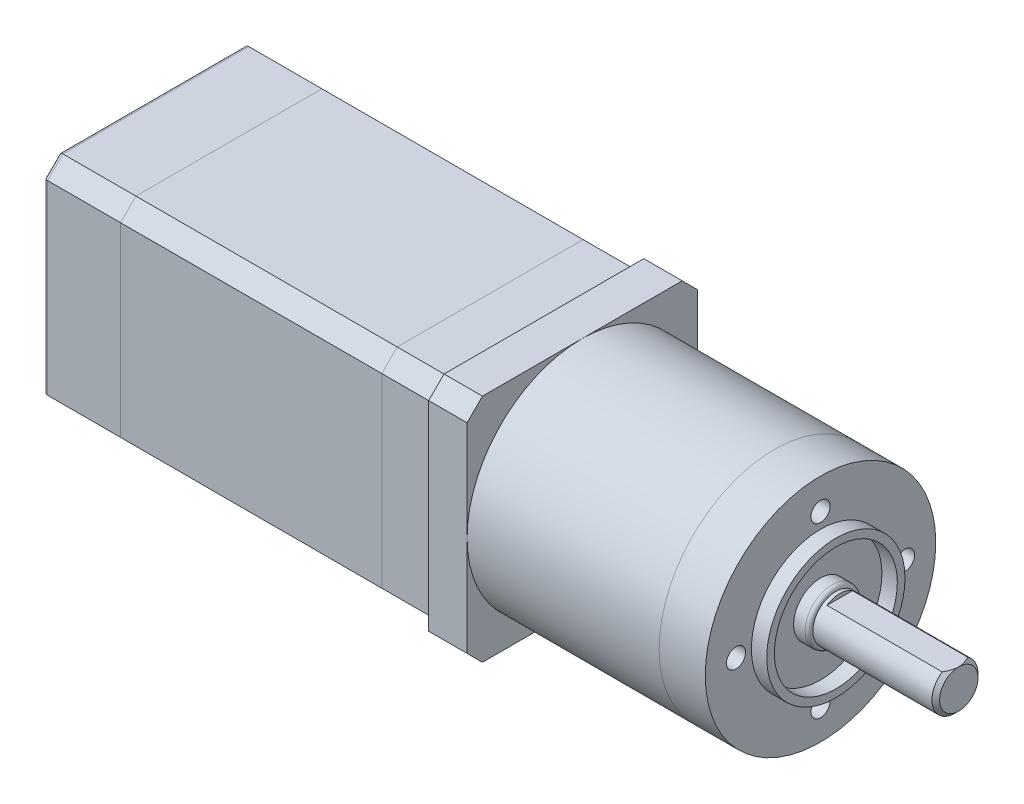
ISO-10303-21;
HEADER;
FILE_DESCRIPTION(('STEP AP214'),'2;1');
FILE_NAME('part.step','',(''),(''),'','','');
FILE_SCHEMA(('AUTOMOTIVE_DESIGN { 1 0 10303 214 1 1 1 1 }'));
ENDSEC;
DATA;
#1=APPLICATION_CONTEXT('core data for automotive mechanical design processes');
#2=APPLICATION_PROTOCOL_DEFINITION('international standard','automotive_design',2000,#1);
#3=PRODUCT_CONTEXT('',#1,'mechanical');
#4=PRODUCT('Part','Part','',(#3));
#5=PRODUCT_RELATED_PRODUCT_CATEGORY('part','',(#4));
#6=PRODUCT_DEFINITION_FORMATION('','',#4);
#7=PRODUCT_DEFINITION_CONTEXT('part definition',#1,'design');
#8=PRODUCT_DEFINITION('design','',#6,#7);
#9=PRODUCT_DEFINITION_SHAPE('','',#8);
#10=(LENGTH_UNIT() NAMED_UNIT(*) SI_UNIT(.MILLI.,.METRE.));
#11=(NAMED_UNIT(*) PLANE_ANGLE_UNIT() SI_UNIT($,.RADIAN.));
#12=(NAMED_UNIT(*) SI_UNIT($,.STERADIAN.) SOLID_ANGLE_UNIT());
#13=UNCERTAINTY_MEASURE_WITH_UNIT(LENGTH_MEASURE(1.E-05),#10,'distance_accuracy_value','');
#14=(GEOMETRIC_REPRESENTATION_CONTEXT(3) GLOBAL_UNCERTAINTY_ASSIGNED_CONTEXT((#13)) GLOBAL_UNIT_ASSIGNED_CONTEXT((#10,
#11,#12)) REPRESENTATION_CONTEXT('',''));
#15=CARTESIAN_POINT('',(0.,0.,0.));
#16=DIRECTION('',(0.,0.,1.));
#17=DIRECTION('',(1.,0.,0.));
#18=AXIS2_PLACEMENT_3D('',#15,#16,#17);
#19=CARTESIAN_POINT('',(24.,0.,0.));
#20=DIRECTION('',(-1.,0.,0.));
#21=DIRECTION('',(0.,0.,1.));
#22=AXIS2_PLACEMENT_3D('',#19,#20,#21);
#23=CYLINDRICAL_SURFACE('',#22,3.);
#24=DIRECTION('',(1.,0.,0.));
#25=VECTOR('',#24,1.);
#26=CARTESIAN_POINT('',(8.5,2.5,-1.6583123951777));
#27=LINE('',#26,#25);
#28=CARTESIAN_POINT('',(8.5,2.5,-1.6583123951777));
#29=VERTEX_POINT('',#28);
#30=CARTESIAN_POINT('',(23.5,2.5,-1.6583123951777));
#31=VERTEX_POINT('',#30);
#32=EDGE_CURVE('E85',#29,#31,#27,.T.);
#33=ORIENTED_EDGE('',*,*,#32,.T.);
#34=CARTESIAN_POINT('',(23.5,0.,0.));
#35=DIRECTION('',(1.,0.,0.));
#36=DIRECTION('',(0.,0.,-1.));
#37=AXIS2_PLACEMENT_3D('',#34,#35,#36);
#38=CIRCLE('',#37,3.);
#39=CARTESIAN_POINT('',(23.5,2.5,1.6583123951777));
#40=VERTEX_POINT('',#39);
#41=EDGE_CURVE('E12',#31,#40,#38,.F.);
#42=ORIENTED_EDGE('',*,*,#41,.T.);
#43=DIRECTION('',(1.,0.,0.));
#44=VECTOR('',#43,1.);
#45=CARTESIAN_POINT('',(8.5,2.5,1.6583123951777));
#46=LINE('',#45,#44);
#47=CARTESIAN_POINT('',(8.5,2.5,1.6583123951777));
#48=VERTEX_POINT('',#47);
#49=EDGE_CURVE('E83',#48,#40,#46,.T.);
#50=ORIENTED_EDGE('',*,*,#49,.F.);
#51=CARTESIAN_POINT('',(8.5,0.,0.));
#52=DIRECTION('',(1.,0.,0.));
#53=DIRECTION('',(0.,0.,-1.));
#54=AXIS2_PLACEMENT_3D('',#51,#52,#53);
#55=CIRCLE('',#54,3.);
#56=EDGE_CURVE('E77',#29,#48,#55,.T.);
#57=ORIENTED_EDGE('',*,*,#56,.F.);
#58=EDGE_LOOP('',(#33,#42,#50,#57));
#59=FACE_BOUND('',#58,.T.);
#60=CARTESIAN_POINT('',(8.,0.,0.));
#61=DIRECTION('',(1.,0.,0.));
#62=DIRECTION('',(0.,0.,-1.));
#63=AXIS2_PLACEMENT_3D('',#60,#61,#62);
#64=CIRCLE('',#63,3.);
#65=CARTESIAN_POINT('',(8.,0.,-3.));
#66=VERTEX_POINT('',#65);
#67=EDGE_CURVE('E89',#66,#66,#64,.T.);
#68=ORIENTED_EDGE('',*,*,#67,.T.);
#69=EDGE_LOOP('',(#68));
#70=FACE_BOUND('',#69,.T.);
#71=ADVANCED_FACE('F46',(#59,#70),#23,.T.);
#72=CARTESIAN_POINT('',(24.,0.,0.));
#73=DIRECTION('',(1.,0.,0.));
#74=DIRECTION('',(0.,0.,-1.));
#75=AXIS2_PLACEMENT_3D('',#72,#73,#74);
#76=PLANE('',#75);
#77=CARTESIAN_POINT('',(24.,0.,0.));
#78=DIRECTION('',(1.,0.,0.));
#79=DIRECTION('',(0.,0.,-1.));
#80=AXIS2_PLACEMENT_3D('',#77,#78,#79);
#81=CIRCLE('',#80,2.50000000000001);
#82=CARTESIAN_POINT('',(24.,2.5,0.));
#83=VERTEX_POINT('',#82);
#84=EDGE_CURVE('E94',#83,#83,#81,.T.);
#85=ORIENTED_EDGE('',*,*,#84,.T.);
#86=EDGE_LOOP('',(#85));
#87=FACE_BOUND('',#86,.T.);
#88=ADVANCED_FACE('F110',(#87),#76,.T.);
#89=CARTESIAN_POINT('',(8.,0.,0.));
#90=DIRECTION('',(1.,0.,0.));
#91=DIRECTION('',(0.,0.,-1.));
#92=AXIS2_PLACEMENT_3D('',#89,#90,#91);
#93=PLANE('',#92);
#94=ORIENTED_EDGE('',*,*,#67,.F.);
#95=EDGE_LOOP('',(#94));
#96=FACE_BOUND('',#95,.T.);
#97=ADVANCED_FACE('F109',(#96),#93,.F.);
#98=CARTESIAN_POINT('',(8.5,2.5,-1.6583123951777));
#99=DIRECTION('',(0.,-1.,0.));
#100=DIRECTION('',(0.,0.,-1.));
#101=AXIS2_PLACEMENT_3D('',#98,#99,#100);
#102=PLANE('',#101);
#103=CARTESIAN_POINT('',(23.5,2.5,1.6583123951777));
#104=CARTESIAN_POINT('',(23.5250200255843,2.5,1.61304419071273));
#105=CARTESIAN_POINT('',(23.549499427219,2.5,1.56747781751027));
#106=CARTESIAN_POINT('',(23.5972096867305,2.5,1.47571363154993));
#107=CARTESIAN_POINT('',(23.6204409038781,2.5,1.42951600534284));
#108=CARTESIAN_POINT('',(23.6882337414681,2.5,1.28946898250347));
#109=CARTESIAN_POINT('',(23.7306685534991,2.5,1.19456817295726));
#110=CARTESIAN_POINT('',(23.8071641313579,2.5,1.00435832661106));
#111=CARTESIAN_POINT('',(23.8414185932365,2.5,0.909128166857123));
#112=CARTESIAN_POINT('',(23.9011186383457,2.5,0.715960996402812));
#113=CARTESIAN_POINT('',(23.9265705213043,2.5,0.618025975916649));
#114=CARTESIAN_POINT('',(23.96395141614,2.5,0.434096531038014));
#115=CARTESIAN_POINT('',(23.9772928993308,2.5,0.348395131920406));
#116=CARTESIAN_POINT('',(23.9908266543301,2.5,0.218706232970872));
#117=CARTESIAN_POINT('',(23.9942588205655,2.5,0.175042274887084));
#118=CARTESIAN_POINT('',(23.9988484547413,2.5,0.0875881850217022));
#119=CARTESIAN_POINT('',(24.0000055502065,2.5,0.0437980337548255));
#120=CARTESIAN_POINT('',(24.,2.5,0.));
#121=B_SPLINE_CURVE_WITH_KNOTS('',3,(#103,#104,#105,#106,#107,#108,#109,#110,#111,#112,#113,
#114,#115,#116,#117,#118,#119,#120),.UNSPECIFIED.,.F.,.F.,(4,2,2,2,2,2,2,2,4),(0.,
0.155160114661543,0.310275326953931,0.621889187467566,0.925164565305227,1.22822244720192,
1.48798349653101,1.61932602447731,1.75069005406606),.UNSPECIFIED.);
#122=EDGE_CURVE('E97',#40,#83,#121,.T.);
#123=ORIENTED_EDGE('',*,*,#122,.T.);
#124=CARTESIAN_POINT('',(24.,2.50000000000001,0.));
#125=CARTESIAN_POINT('',(24.0000643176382,2.5,-0.0768428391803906));
#126=CARTESIAN_POINT('',(23.9964585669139,2.5,-0.153646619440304));
#127=CARTESIAN_POINT('',(23.9824138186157,2.5,-0.306486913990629));
#128=CARTESIAN_POINT('',(23.9719877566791,2.5,-0.38252460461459));
#129=CARTESIAN_POINT('',(23.9450231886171,2.5,-0.532231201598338));
#130=CARTESIAN_POINT('',(23.9285851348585,2.5,-0.605918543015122));
#131=CARTESIAN_POINT('',(23.8903277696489,2.5,-0.751897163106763));
#132=CARTESIAN_POINT('',(23.8685063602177,2.5,-0.824187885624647));
#133=CARTESIAN_POINT('',(23.8222417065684,2.5,-0.961361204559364));
#134=CARTESIAN_POINT('',(23.7981581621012,2.5,-1.02636662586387));
#135=CARTESIAN_POINT('',(23.7466971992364,2.5,-1.15505562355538));
#136=CARTESIAN_POINT('',(23.7193196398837,2.5,-1.21873914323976));
#137=CARTESIAN_POINT('',(23.6613450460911,2.5,-1.34581351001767));
#138=CARTESIAN_POINT('',(23.6307045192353,2.5,-1.40918435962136));
#139=CARTESIAN_POINT('',(23.567035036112,2.5,-1.53466113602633));
#140=CARTESIAN_POINT('',(23.5340077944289,2.5,-1.59676793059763));
#141=CARTESIAN_POINT('',(23.5,2.5,-1.6583123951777));
#142=B_SPLINE_CURVE_WITH_KNOTS('',3,(#124,#125,#126,#127,#128,#129,#130,#131,#132,#133,#134,
#135,#136,#137,#138,#139,#140,#141),.UNSPECIFIED.,.F.,.F.,(4,2,2,2,2,2,2,2,4),(0.,
0.230381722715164,0.460327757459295,0.68659521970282,0.912951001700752,1.120819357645,
1.32869661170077,1.53981070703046,1.75077462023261),.UNSPECIFIED.);
#143=EDGE_CURVE('E55',#83,#31,#142,.T.);
#144=ORIENTED_EDGE('',*,*,#143,.T.);
#145=ORIENTED_EDGE('',*,*,#32,.F.);
#146=DIRECTION('',(0.,0.,-1.));
#147=VECTOR('',#146,1.);
#148=CARTESIAN_POINT('',(8.5,2.5,-1.6583123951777));
#149=LINE('',#148,#147);
#150=EDGE_CURVE('E80',#48,#29,#149,.T.);
#151=ORIENTED_EDGE('',*,*,#150,.F.);
#152=ORIENTED_EDGE('',*,*,#49,.T.);
#153=EDGE_LOOP('',(#123,#144,#145,#151,#152));
#154=FACE_BOUND('',#153,.T.);
#155=ADVANCED_FACE('F82',(#154),#102,.F.);
#156=CARTESIAN_POINT('',(8.5,0.,0.));
#157=DIRECTION('',(1.,0.,0.));
#158=DIRECTION('',(0.,0.,-1.));
#159=AXIS2_PLACEMENT_3D('',#156,#157,#158);
#160=PLANE('',#159);
#161=ORIENTED_EDGE('',*,*,#56,.T.);
#162=ORIENTED_EDGE('',*,*,#150,.T.);
#163=EDGE_LOOP('',(#161,#162));
#164=FACE_BOUND('',#163,.T.);
#165=ADVANCED_FACE('F79',(#164),#160,.T.);
#166=CARTESIAN_POINT('',(24.,0.,0.));
#167=DIRECTION('',(-1.,0.,0.));
#168=DIRECTION('',(0.,0.,1.));
#169=AXIS2_PLACEMENT_3D('',#166,#167,#168);
#170=CONICAL_SURFACE('',#169,2.50000000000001,0.785398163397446);
#171=ORIENTED_EDGE('',*,*,#122,.F.);
#172=ORIENTED_EDGE('',*,*,#41,.F.);
#173=ORIENTED_EDGE('',*,*,#143,.F.);
#174=ORIENTED_EDGE('',*,*,#84,.F.);
#175=EDGE_LOOP('',(#171,#172,#173,#174));
#176=FACE_BOUND('',#175,.T.);
#177=ADVANCED_FACE('F48',(#176),#170,.T.);
#178=CLOSED_SHELL('',(#71,#88,#97,#155,#165,#177));
#179=MANIFOLD_SOLID_BREP('B2',#178);
#180=CARTESIAN_POINT('',(-81.,12.1,-14.1));
#181=DIRECTION('',(0.,-0.707106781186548,0.707106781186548));
#182=DIRECTION('',(0.,-0.707106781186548,-0.707106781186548));
#183=AXIS2_PLACEMENT_3D('',#180,#181,#182);
#184=PLANE('',#183);
#185=DIRECTION('',(1.,0.,0.));
#186=VECTOR('',#185,1.);
#187=CARTESIAN_POINT('',(-81.,12.1,-14.1));
#188=LINE('',#187,#186);
#189=CARTESIAN_POINT('',(-80.5,12.1,-14.1));
#190=VERTEX_POINT('',#189);
#191=CARTESIAN_POINT('',(-71.,12.1,-14.1));
#192=VERTEX_POINT('',#191);
#193=EDGE_CURVE('E261',#190,#192,#188,.T.);
#194=ORIENTED_EDGE('',*,*,#193,.F.);
#195=DIRECTION('',(0.,-0.707106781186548,-0.707106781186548));
#196=VECTOR('',#195,1.);
#197=CARTESIAN_POINT('',(-80.5,14.1,-12.1));
#198=LINE('',#197,#196);
#199=CARTESIAN_POINT('',(-80.5,14.1,-12.1));
#200=VERTEX_POINT('',#199);
#201=EDGE_CURVE('E44',#190,#200,#198,.F.);
#202=ORIENTED_EDGE('',*,*,#201,.T.);
#203=DIRECTION('',(1.,0.,0.));
#204=VECTOR('',#203,1.);
#205=CARTESIAN_POINT('',(-81.,14.1,-12.1));
#206=LINE('',#205,#204);
#207=CARTESIAN_POINT('',(-71.,14.1,-12.1));
#208=VERTEX_POINT('',#207);
#209=EDGE_CURVE('E282',#200,#208,#206,.T.);
#210=ORIENTED_EDGE('',*,*,#209,.T.);
#211=DIRECTION('',(0.,-0.707106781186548,-0.707106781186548));
#212=VECTOR('',#211,1.);
#213=CARTESIAN_POINT('',(-71.,12.1,-14.1));
#214=LINE('',#213,#212);
#215=EDGE_CURVE('E276',#208,#192,#214,.T.);
#216=ORIENTED_EDGE('',*,*,#215,.T.);
#217=EDGE_LOOP('',(#194,#202,#210,#216));
#218=FACE_BOUND('',#217,.T.);
#219=ADVANCED_FACE('F173',(#218),#184,.F.);
#220=CARTESIAN_POINT('',(-81.,-12.1,-14.1));
#221=DIRECTION('',(0.,0.,1.));
#222=DIRECTION('',(1.,0.,0.));
#223=AXIS2_PLACEMENT_3D('',#220,#221,#222);
#224=PLANE('',#223);
#225=DIRECTION('',(1.,0.,0.));
#226=VECTOR('',#225,1.);
#227=CARTESIAN_POINT('',(-81.,-12.1,-14.1));
#228=LINE('',#227,#226);
#229=CARTESIAN_POINT('',(-80.5,-12.1,-14.1));
#230=VERTEX_POINT('',#229);
#231=CARTESIAN_POINT('',(-71.,-12.1,-14.1));
#232=VERTEX_POINT('',#231);
#233=EDGE_CURVE('E270',#230,#232,#228,.T.);
#234=ORIENTED_EDGE('',*,*,#233,.F.);
#235=DIRECTION('',(0.,-1.,0.));
#236=VECTOR('',#235,1.);
#237=CARTESIAN_POINT('',(-80.5,12.1,-14.1));
#238=LINE('',#237,#236);
#239=EDGE_CURVE('E182',#230,#190,#238,.F.);
#240=ORIENTED_EDGE('',*,*,#239,.T.);
#241=ORIENTED_EDGE('',*,*,#193,.T.);
#242=DIRECTION('',(0.,-1.,0.));
#243=VECTOR('',#242,1.);
#244=CARTESIAN_POINT('',(-71.,-12.1,-14.1));
#245=LINE('',#244,#243);
#246=EDGE_CURVE('E264',#192,#232,#245,.T.);
#247=ORIENTED_EDGE('',*,*,#246,.T.);
#248=EDGE_LOOP('',(#234,#240,#241,#247));
#249=FACE_BOUND('',#248,.T.);
#250=ADVANCED_FACE('F263',(#249),#224,.F.);
#251=CARTESIAN_POINT('',(-81.,-14.1,-12.1));
#252=DIRECTION('',(0.,0.707106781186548,0.707106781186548));
#253=DIRECTION('',(0.,-0.707106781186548,0.707106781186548));
#254=AXIS2_PLACEMENT_3D('',#251,#252,#253);
#255=PLANE('',#254);
#256=DIRECTION('',(1.,0.,0.));
#257=VECTOR('',#256,1.);
#258=CARTESIAN_POINT('',(-81.,-14.1,-12.1));
#259=LINE('',#258,#257);
#260=CARTESIAN_POINT('',(-80.5,-14.1,-12.1));
#261=VERTEX_POINT('',#260);
#262=CARTESIAN_POINT('',(-71.,-14.1,-12.1));
#263=VERTEX_POINT('',#262);
#264=EDGE_CURVE('E312',#261,#263,#259,.T.);
#265=ORIENTED_EDGE('',*,*,#264,.F.);
#266=DIRECTION('',(0.,-0.707106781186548,0.707106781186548));
#267=VECTOR('',#266,1.);
#268=CARTESIAN_POINT('',(-80.5,-12.1,-14.1));
#269=LINE('',#268,#267);
#270=EDGE_CURVE('E197',#261,#230,#269,.F.);
#271=ORIENTED_EDGE('',*,*,#270,.T.);
#272=ORIENTED_EDGE('',*,*,#233,.T.);
#273=DIRECTION('',(0.,-0.707106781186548,0.707106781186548));
#274=VECTOR('',#273,1.);
#275=CARTESIAN_POINT('',(-71.,-14.1,-12.1));
#276=LINE('',#275,#274);
#277=EDGE_CURVE('E279',#232,#263,#276,.T.);
#278=ORIENTED_EDGE('',*,*,#277,.T.);
#279=EDGE_LOOP('',(#265,#271,#272,#278));
#280=FACE_BOUND('',#279,.T.);
#281=ADVANCED_FACE('F415',(#280),#255,.F.);
#282=CARTESIAN_POINT('',(-81.,-14.1,-12.1));
#283=DIRECTION('',(0.,1.,0.));
#284=DIRECTION('',(0.,0.,1.));
#285=AXIS2_PLACEMENT_3D('',#282,#283,#284);
#286=PLANE('',#285);
#287=DIRECTION('',(1.,0.,0.));
#288=VECTOR('',#287,1.);
#289=CARTESIAN_POINT('',(-81.,-14.1,12.1));
#290=LINE('',#289,#288);
#291=CARTESIAN_POINT('',(-80.5,-14.1,12.1));
#292=VERTEX_POINT('',#291);
#293=CARTESIAN_POINT('',(-71.,-14.1,12.1));
#294=VERTEX_POINT('',#293);
#295=EDGE_CURVE('E310',#292,#294,#290,.T.);
#296=ORIENTED_EDGE('',*,*,#295,.F.);
#297=DIRECTION('',(0.,0.,1.));
#298=VECTOR('',#297,1.);
#299=CARTESIAN_POINT('',(-80.5,-14.1,-12.1));
#300=LINE('',#299,#298);
#301=EDGE_CURVE('E340',#292,#261,#300,.F.);
#302=ORIENTED_EDGE('',*,*,#301,.T.);
#303=ORIENTED_EDGE('',*,*,#264,.T.);
#304=DIRECTION('',(0.,0.,1.));
#305=VECTOR('',#304,1.);
#306=CARTESIAN_POINT('',(-71.,-14.1,-12.1));
#307=LINE('',#306,#305);
#308=EDGE_CURVE('E289',#263,#294,#307,.T.);
#309=ORIENTED_EDGE('',*,*,#308,.T.);
#310=EDGE_LOOP('',(#296,#302,#303,#309));
#311=FACE_BOUND('',#310,.T.);
#312=ADVANCED_FACE('F413',(#311),#286,.F.);
#313=CARTESIAN_POINT('',(-81.,-14.1,12.1));
#314=DIRECTION('',(0.,0.707106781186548,-0.707106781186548));
#315=DIRECTION('',(0.,0.707106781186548,0.707106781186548));
#316=AXIS2_PLACEMENT_3D('',#313,#314,#315);
#317=PLANE('',#316);
#318=DIRECTION('',(1.,0.,0.));
#319=VECTOR('',#318,1.);
#320=CARTESIAN_POINT('',(-81.,-12.1,14.1));
#321=LINE('',#320,#319);
#322=CARTESIAN_POINT('',(-80.5,-12.1,14.1));
#323=VERTEX_POINT('',#322);
#324=CARTESIAN_POINT('',(-71.,-12.1,14.1));
#325=VERTEX_POINT('',#324);
#326=EDGE_CURVE('E308',#323,#325,#321,.T.);
#327=ORIENTED_EDGE('',*,*,#326,.F.);
#328=DIRECTION('',(0.,0.707106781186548,0.707106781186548));
#329=VECTOR('',#328,1.);
#330=CARTESIAN_POINT('',(-80.5,-14.1,12.1));
#331=LINE('',#330,#329);
#332=EDGE_CURVE('E338',#323,#292,#331,.F.);
#333=ORIENTED_EDGE('',*,*,#332,.T.);
#334=ORIENTED_EDGE('',*,*,#295,.T.);
#335=DIRECTION('',(0.,0.707106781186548,0.707106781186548));
#336=VECTOR('',#335,1.);
#337=CARTESIAN_POINT('',(-71.,-14.1,12.1));
#338=LINE('',#337,#336);
#339=EDGE_CURVE('E292',#294,#325,#338,.T.);
#340=ORIENTED_EDGE('',*,*,#339,.T.);
#341=EDGE_LOOP('',(#327,#333,#334,#340));
#342=FACE_BOUND('',#341,.T.);
#343=ADVANCED_FACE('F411',(#342),#317,.F.);
#344=CARTESIAN_POINT('',(-81.,-12.1,14.1));
#345=DIRECTION('',(0.,0.,-1.));
#346=DIRECTION('',(0.,1.,0.));
#347=AXIS2_PLACEMENT_3D('',#344,#345,#346);
#348=PLANE('',#347);
#349=DIRECTION('',(1.,0.,0.));
#350=VECTOR('',#349,1.);
#351=CARTESIAN_POINT('',(-81.,12.1,14.1));
#352=LINE('',#351,#350);
#353=CARTESIAN_POINT('',(-80.5,12.1,14.1));
#354=VERTEX_POINT('',#353);
#355=CARTESIAN_POINT('',(-71.,12.1,14.1));
#356=VERTEX_POINT('',#355);
#357=EDGE_CURVE('E306',#354,#356,#352,.T.);
#358=ORIENTED_EDGE('',*,*,#357,.F.);
#359=DIRECTION('',(0.,1.,0.));
#360=VECTOR('',#359,1.);
#361=CARTESIAN_POINT('',(-80.5,-12.1,14.1));
#362=LINE('',#361,#360);
#363=EDGE_CURVE('E336',#354,#323,#362,.F.);
#364=ORIENTED_EDGE('',*,*,#363,.T.);
#365=ORIENTED_EDGE('',*,*,#326,.T.);
#366=DIRECTION('',(0.,1.,0.));
#367=VECTOR('',#366,1.);
#368=CARTESIAN_POINT('',(-71.,-12.1,14.1));
#369=LINE('',#368,#367);
#370=EDGE_CURVE('E295',#325,#356,#369,.T.);
#371=ORIENTED_EDGE('',*,*,#370,.T.);
#372=EDGE_LOOP('',(#358,#364,#365,#371));
#373=FACE_BOUND('',#372,.T.);
#374=ADVANCED_FACE('F399',(#373),#348,.F.);
#375=CARTESIAN_POINT('',(-81.,12.1,14.1));
#376=DIRECTION('',(0.,-0.707106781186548,-0.707106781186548));
#377=DIRECTION('',(0.,0.707106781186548,-0.707106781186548));
#378=AXIS2_PLACEMENT_3D('',#375,#376,#377);
#379=PLANE('',#378);
#380=DIRECTION('',(1.,0.,0.));
#381=VECTOR('',#380,1.);
#382=CARTESIAN_POINT('',(-81.,14.1,12.1));
#383=LINE('',#382,#381);
#384=CARTESIAN_POINT('',(-80.5,14.1,12.1));
#385=VERTEX_POINT('',#384);
#386=CARTESIAN_POINT('',(-71.,14.1,12.1));
#387=VERTEX_POINT('',#386);
#388=EDGE_CURVE('E304',#385,#387,#383,.T.);
#389=ORIENTED_EDGE('',*,*,#388,.F.);
#390=DIRECTION('',(0.,0.707106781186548,-0.707106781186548));
#391=VECTOR('',#390,1.);
#392=CARTESIAN_POINT('',(-80.5,12.1,14.1));
#393=LINE('',#392,#391);
#394=EDGE_CURVE('E334',#385,#354,#393,.F.);
#395=ORIENTED_EDGE('',*,*,#394,.T.);
#396=ORIENTED_EDGE('',*,*,#357,.T.);
#397=DIRECTION('',(0.,0.707106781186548,-0.707106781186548));
#398=VECTOR('',#397,1.);
#399=CARTESIAN_POINT('',(-71.,12.1,14.1));
#400=LINE('',#399,#398);
#401=EDGE_CURVE('E298',#356,#387,#400,.T.);
#402=ORIENTED_EDGE('',*,*,#401,.T.);
#403=EDGE_LOOP('',(#389,#395,#396,#402));
#404=FACE_BOUND('',#403,.T.);
#405=ADVANCED_FACE('F396',(#404),#379,.F.);
#406=CARTESIAN_POINT('',(-81.,14.1,-12.1));
#407=DIRECTION('',(0.,-1.,0.));
#408=DIRECTION('',(0.,0.,-1.));
#409=AXIS2_PLACEMENT_3D('',#406,#407,#408);
#410=PLANE('',#409);
#411=ORIENTED_EDGE('',*,*,#209,.F.);
#412=DIRECTION('',(0.,0.,-1.));
#413=VECTOR('',#412,1.);
#414=CARTESIAN_POINT('',(-80.5,14.1,12.1));
#415=LINE('',#414,#413);
#416=EDGE_CURVE('E331',#200,#385,#415,.F.);
#417=ORIENTED_EDGE('',*,*,#416,.T.);
#418=ORIENTED_EDGE('',*,*,#388,.T.);
#419=DIRECTION('',(0.,0.,-1.));
#420=VECTOR('',#419,1.);
#421=CARTESIAN_POINT('',(-71.,14.1,-12.1));
#422=LINE('',#421,#420);
#423=EDGE_CURVE('E301',#387,#208,#422,.T.);
#424=ORIENTED_EDGE('',*,*,#423,.T.);
#425=EDGE_LOOP('',(#411,#417,#418,#424));
#426=FACE_BOUND('',#425,.T.);
#427=ADVANCED_FACE('F383',(#426),#410,.F.);
#428=CARTESIAN_POINT('',(-81.,0.,0.));
#429=DIRECTION('',(-1.,0.,0.));
#430=DIRECTION('',(0.,0.,1.));
#431=AXIS2_PLACEMENT_3D('',#428,#429,#430);
#432=PLANE('',#431);
#433=DIRECTION('',(0.,0.707106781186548,-0.707106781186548));
#434=VECTOR('',#433,1.);
#435=CARTESIAN_POINT('',(-81.,13.7464466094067,11.7464466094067));
#436=LINE('',#435,#434);
#437=CARTESIAN_POINT('',(-81.,11.8928932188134,13.6));
#438=VERTEX_POINT('',#437);
#439=CARTESIAN_POINT('',(-81.,13.6,11.8928932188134));
#440=VERTEX_POINT('',#439);
#441=EDGE_CURVE('E326',#438,#440,#436,.T.);
#442=ORIENTED_EDGE('',*,*,#441,.T.);
#443=DIRECTION('',(0.,0.,-1.));
#444=VECTOR('',#443,1.);
#445=CARTESIAN_POINT('',(-81.,13.6,-12.1));
#446=LINE('',#445,#444);
#447=CARTESIAN_POINT('',(-81.,13.6,-11.8928932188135));
#448=VERTEX_POINT('',#447);
#449=EDGE_CURVE('E328',#440,#448,#446,.T.);
#450=ORIENTED_EDGE('',*,*,#449,.T.);
#451=DIRECTION('',(0.,-0.707106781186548,-0.707106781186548));
#452=VECTOR('',#451,1.);
#453=CARTESIAN_POINT('',(-81.,11.7464466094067,-13.7464466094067));
#454=LINE('',#453,#452);
#455=CARTESIAN_POINT('',(-81.,11.8928932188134,-13.6));
#456=VERTEX_POINT('',#455);
#457=EDGE_CURVE('E269',#448,#456,#454,.T.);
#458=ORIENTED_EDGE('',*,*,#457,.T.);
#459=DIRECTION('',(0.,-1.,0.));
#460=VECTOR('',#459,1.);
#461=CARTESIAN_POINT('',(-81.,-12.1,-13.6));
#462=LINE('',#461,#460);
#463=CARTESIAN_POINT('',(-81.,-11.8928932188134,-13.6));
#464=VERTEX_POINT('',#463);
#465=EDGE_CURVE('E316',#456,#464,#462,.T.);
#466=ORIENTED_EDGE('',*,*,#465,.T.);
#467=DIRECTION('',(0.,-0.707106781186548,0.707106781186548));
#468=VECTOR('',#467,1.);
#469=CARTESIAN_POINT('',(-81.,-13.7464466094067,-11.7464466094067));
#470=LINE('',#469,#468);
#471=CARTESIAN_POINT('',(-81.,-13.6,-11.8928932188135));
#472=VERTEX_POINT('',#471);
#473=EDGE_CURVE('E318',#464,#472,#470,.T.);
#474=ORIENTED_EDGE('',*,*,#473,.T.);
#475=DIRECTION('',(0.,0.,1.));
#476=VECTOR('',#475,1.);
#477=CARTESIAN_POINT('',(-81.,-13.6,12.1));
#478=LINE('',#477,#476);
#479=CARTESIAN_POINT('',(-81.,-13.6,11.8928932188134));
#480=VERTEX_POINT('',#479);
#481=EDGE_CURVE('E320',#472,#480,#478,.T.);
#482=ORIENTED_EDGE('',*,*,#481,.T.);
#483=DIRECTION('',(0.,0.707106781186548,0.707106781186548));
#484=VECTOR('',#483,1.);
#485=CARTESIAN_POINT('',(-81.,-11.7464466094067,13.7464466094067));
#486=LINE('',#485,#484);
#487=CARTESIAN_POINT('',(-81.,-11.8928932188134,13.6));
#488=VERTEX_POINT('',#487);
#489=EDGE_CURVE('E322',#480,#488,#486,.T.);
#490=ORIENTED_EDGE('',*,*,#489,.T.);
#491=DIRECTION('',(0.,1.,0.));
#492=VECTOR('',#491,1.);
#493=CARTESIAN_POINT('',(-81.,12.1,13.6));
#494=LINE('',#493,#492);
#495=EDGE_CURVE('E324',#488,#438,#494,.T.);
#496=ORIENTED_EDGE('',*,*,#495,.T.);
#497=EDGE_LOOP('',(#442,#450,#458,#466,#474,#482,#490,#496));
#498=FACE_BOUND('',#497,.T.);
#499=ADVANCED_FACE('F371',(#498),#432,.T.);
#500=CARTESIAN_POINT('',(-71.,0.,0.));
#501=DIRECTION('',(-1.,0.,0.));
#502=DIRECTION('',(0.,0.,1.));
#503=AXIS2_PLACEMENT_3D('',#500,#501,#502);
#504=PLANE('',#503);
#505=ORIENTED_EDGE('',*,*,#215,.F.);
#506=ORIENTED_EDGE('',*,*,#423,.F.);
#507=ORIENTED_EDGE('',*,*,#401,.F.);
#508=ORIENTED_EDGE('',*,*,#370,.F.);
#509=ORIENTED_EDGE('',*,*,#339,.F.);
#510=ORIENTED_EDGE('',*,*,#308,.F.);
#511=ORIENTED_EDGE('',*,*,#277,.F.);
#512=ORIENTED_EDGE('',*,*,#246,.F.);
#513=EDGE_LOOP('',(#505,#506,#507,#508,#509,#510,#511,#512));
#514=FACE_BOUND('',#513,.T.);
#515=ADVANCED_FACE('F274',(#514),#504,.F.);
#516=CARTESIAN_POINT('',(-80.5,-13.6,0.));
#517=DIRECTION('',(0.,0.,-1.));
#518=DIRECTION('',(-1.,0.,0.));
#519=AXIS2_PLACEMENT_3D('',#516,#517,#518);
#520=CYLINDRICAL_SURFACE('',#519,0.5);
#521=CARTESIAN_POINT('',(-80.5,-13.6,-11.8928932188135));
#522=DIRECTION('',(0.,0.38268343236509,-0.923879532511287));
#523=DIRECTION('',(0.,0.923879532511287,0.38268343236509));
#524=AXIS2_PLACEMENT_3D('',#521,#522,#523);
#525=ELLIPSE('',#524,0.541196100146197,0.5);
#526=EDGE_CURVE('E286',#261,#472,#525,.T.);
#527=ORIENTED_EDGE('',*,*,#526,.F.);
#528=ORIENTED_EDGE('',*,*,#301,.F.);
#529=CARTESIAN_POINT('',(-80.5,-13.6,11.8928932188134));
#530=DIRECTION('',(0.,-0.38268343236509,-0.923879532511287));
#531=DIRECTION('',(0.,0.923879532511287,-0.38268343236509));
#532=AXIS2_PLACEMENT_3D('',#529,#530,#531);
#533=ELLIPSE('',#532,0.541196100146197,0.5);
#534=EDGE_CURVE('E177',#480,#292,#533,.F.);
#535=ORIENTED_EDGE('',*,*,#534,.F.);
#536=ORIENTED_EDGE('',*,*,#481,.F.);
#537=EDGE_LOOP('',(#527,#528,#535,#536));
#538=FACE_BOUND('',#537,.T.);
#539=ADVANCED_FACE('F175',(#538),#520,.T.);
#540=CARTESIAN_POINT('',(-80.5,-12.7464466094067,12.7464466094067));
#541=DIRECTION('',(0.,-0.707106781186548,-0.707106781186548));
#542=DIRECTION('',(0.,0.707106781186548,-0.707106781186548));
#543=AXIS2_PLACEMENT_3D('',#540,#541,#542);
#544=CYLINDRICAL_SURFACE('',#543,0.5);
#545=ORIENTED_EDGE('',*,*,#534,.T.);
#546=ORIENTED_EDGE('',*,*,#332,.F.);
#547=CARTESIAN_POINT('',(-80.5,-11.8928932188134,13.6));
#548=DIRECTION('',(0.,-0.923879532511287,-0.38268343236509));
#549=DIRECTION('',(0.,0.38268343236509,-0.923879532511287));
#550=AXIS2_PLACEMENT_3D('',#547,#548,#549);
#551=ELLIPSE('',#550,0.541196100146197,0.5);
#552=EDGE_CURVE('E357',#488,#323,#551,.F.);
#553=ORIENTED_EDGE('',*,*,#552,.F.);
#554=ORIENTED_EDGE('',*,*,#489,.F.);
#555=EDGE_LOOP('',(#545,#546,#553,#554));
#556=FACE_BOUND('',#555,.T.);
#557=ADVANCED_FACE('F408',(#556),#544,.T.);
#558=CARTESIAN_POINT('',(-80.5,-12.7464466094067,-12.7464466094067));
#559=DIRECTION('',(0.,0.707106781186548,-0.707106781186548));
#560=DIRECTION('',(0.,0.707106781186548,0.707106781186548));
#561=AXIS2_PLACEMENT_3D('',#558,#559,#560);
#562=CYLINDRICAL_SURFACE('',#561,0.5);
#563=ORIENTED_EDGE('',*,*,#526,.T.);
#564=ORIENTED_EDGE('',*,*,#473,.F.);
#565=CARTESIAN_POINT('',(-80.5,-11.8928932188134,-13.6));
#566=DIRECTION('',(0.,0.923879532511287,-0.38268343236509));
#567=DIRECTION('',(0.,0.38268343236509,0.923879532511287));
#568=AXIS2_PLACEMENT_3D('',#565,#566,#567);
#569=ELLIPSE('',#568,0.541196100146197,0.5);
#570=EDGE_CURVE('E354',#230,#464,#569,.T.);
#571=ORIENTED_EDGE('',*,*,#570,.F.);
#572=ORIENTED_EDGE('',*,*,#270,.F.);
#573=EDGE_LOOP('',(#563,#564,#571,#572));
#574=FACE_BOUND('',#573,.T.);
#575=ADVANCED_FACE('F363',(#574),#562,.T.);
#576=CARTESIAN_POINT('',(-80.5,0.,13.6));
#577=DIRECTION('',(0.,-1.,0.));
#578=DIRECTION('',(0.,0.,-1.));
#579=AXIS2_PLACEMENT_3D('',#576,#577,#578);
#580=CYLINDRICAL_SURFACE('',#579,0.5);
#581=ORIENTED_EDGE('',*,*,#552,.T.);
#582=ORIENTED_EDGE('',*,*,#363,.F.);
#583=CARTESIAN_POINT('',(-80.5,11.8928932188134,13.6));
#584=DIRECTION('',(0.,-0.923879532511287,0.38268343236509));
#585=DIRECTION('',(0.,-0.38268343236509,-0.923879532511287));
#586=AXIS2_PLACEMENT_3D('',#583,#584,#585);
#587=ELLIPSE('',#586,0.541196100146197,0.5);
#588=EDGE_CURVE('E351',#438,#354,#587,.F.);
#589=ORIENTED_EDGE('',*,*,#588,.F.);
#590=ORIENTED_EDGE('',*,*,#495,.F.);
#591=EDGE_LOOP('',(#581,#582,#589,#590));
#592=FACE_BOUND('',#591,.T.);
#593=ADVANCED_FACE('F404',(#592),#580,.T.);
#594=CARTESIAN_POINT('',(-80.5,0.,-13.6));
#595=DIRECTION('',(0.,1.,0.));
#596=DIRECTION('',(0.,0.,1.));
#597=AXIS2_PLACEMENT_3D('',#594,#595,#596);
#598=CYLINDRICAL_SURFACE('',#597,0.5);
#599=ORIENTED_EDGE('',*,*,#570,.T.);
#600=ORIENTED_EDGE('',*,*,#465,.F.);
#601=CARTESIAN_POINT('',(-80.5,11.8928932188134,-13.6));
#602=DIRECTION('',(0.,0.923879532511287,0.38268343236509));
#603=DIRECTION('',(0.,-0.38268343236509,0.923879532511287));
#604=AXIS2_PLACEMENT_3D('',#601,#602,#603);
#605=ELLIPSE('',#604,0.541196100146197,0.5);
#606=EDGE_CURVE('E348',#190,#456,#605,.T.);
#607=ORIENTED_EDGE('',*,*,#606,.F.);
#608=ORIENTED_EDGE('',*,*,#239,.F.);
#609=EDGE_LOOP('',(#599,#600,#607,#608));
#610=FACE_BOUND('',#609,.T.);
#611=ADVANCED_FACE('F376',(#610),#598,.T.);
#612=CARTESIAN_POINT('',(-80.5,12.7464466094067,12.7464466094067));
#613=DIRECTION('',(0.,-0.707106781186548,0.707106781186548));
#614=DIRECTION('',(0.,-0.707106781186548,-0.707106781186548));
#615=AXIS2_PLACEMENT_3D('',#612,#613,#614);
#616=CYLINDRICAL_SURFACE('',#615,0.5);
#617=ORIENTED_EDGE('',*,*,#588,.T.);
#618=ORIENTED_EDGE('',*,*,#394,.F.);
#619=CARTESIAN_POINT('',(-80.5,13.6,11.8928932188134));
#620=DIRECTION('',(0.,-0.38268343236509,0.923879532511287));
#621=DIRECTION('',(0.,-0.923879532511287,-0.38268343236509));
#622=AXIS2_PLACEMENT_3D('',#619,#620,#621);
#623=ELLIPSE('',#622,0.541196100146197,0.5);
#624=EDGE_CURVE('E346',#440,#385,#623,.F.);
#625=ORIENTED_EDGE('',*,*,#624,.F.);
#626=ORIENTED_EDGE('',*,*,#441,.F.);
#627=EDGE_LOOP('',(#617,#618,#625,#626));
#628=FACE_BOUND('',#627,.T.);
#629=ADVANCED_FACE('F392',(#628),#616,.T.);
#630=CARTESIAN_POINT('',(-80.5,12.7464466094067,-12.7464466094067));
#631=DIRECTION('',(0.,0.707106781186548,0.707106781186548));
#632=DIRECTION('',(0.,-0.707106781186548,0.707106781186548));
#633=AXIS2_PLACEMENT_3D('',#630,#631,#632);
#634=CYLINDRICAL_SURFACE('',#633,0.5);
#635=ORIENTED_EDGE('',*,*,#606,.T.);
#636=ORIENTED_EDGE('',*,*,#457,.F.);
#637=CARTESIAN_POINT('',(-80.5,13.6,-11.8928932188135));
#638=DIRECTION('',(0.,0.38268343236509,0.923879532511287));
#639=DIRECTION('',(0.,0.923879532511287,-0.38268343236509));
#640=AXIS2_PLACEMENT_3D('',#637,#638,#639);
#641=ELLIPSE('',#640,0.541196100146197,0.5);
#642=EDGE_CURVE('E344',#200,#448,#641,.T.);
#643=ORIENTED_EDGE('',*,*,#642,.F.);
#644=ORIENTED_EDGE('',*,*,#201,.F.);
#645=EDGE_LOOP('',(#635,#636,#643,#644));
#646=FACE_BOUND('',#645,.T.);
#647=ADVANCED_FACE('F379',(#646),#634,.T.);
#648=CARTESIAN_POINT('',(-80.5,13.6,0.));
#649=DIRECTION('',(0.,0.,1.));
#650=DIRECTION('',(0.,-1.,0.));
#651=AXIS2_PLACEMENT_3D('',#648,#649,#650);
#652=CYLINDRICAL_SURFACE('',#651,0.5);
#653=ORIENTED_EDGE('',*,*,#624,.T.);
#654=ORIENTED_EDGE('',*,*,#416,.F.);
#655=ORIENTED_EDGE('',*,*,#642,.T.);
#656=ORIENTED_EDGE('',*,*,#449,.F.);
#657=EDGE_LOOP('',(#653,#654,#655,#656));
#658=FACE_BOUND('',#657,.T.);
#659=ADVANCED_FACE('F386',(#658),#652,.T.);
#660=CLOSED_SHELL('',(#219,#250,#281,#312,#343,#374,#405,#427,#499,#515,#539,#557,#575,#593,
#611,#629,#647,#659));
#661=MANIFOLD_SOLID_BREP('B6',#660);
#662=CARTESIAN_POINT('',(-71.,12.1,-14.1));
#663=DIRECTION('',(0.,-0.707106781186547,0.707106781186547));
#664=DIRECTION('',(0.,-0.707106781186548,-0.707106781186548));
#665=AXIS2_PLACEMENT_3D('',#662,#663,#664);
#666=PLANE('',#665);
#667=DIRECTION('',(0.,-0.707106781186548,-0.707106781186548));
#668=VECTOR('',#667,1.);
#669=CARTESIAN_POINT('',(-37.,12.1,-14.1));
#670=LINE('',#669,#668);
#671=CARTESIAN_POINT('',(-37.,14.1,-12.1));
#672=VERTEX_POINT('',#671);
#673=CARTESIAN_POINT('',(-37.,12.1,-14.1));
#674=VERTEX_POINT('',#673);
#675=EDGE_CURVE('E667',#672,#674,#670,.T.);
#676=ORIENTED_EDGE('',*,*,#675,.T.);
#677=DIRECTION('',(1.,0.,0.));
#678=VECTOR('',#677,1.);
#679=CARTESIAN_POINT('',(-71.,12.1,-14.1));
#680=LINE('',#679,#678);
#681=CARTESIAN_POINT('',(-71.,12.1,-14.1));
#682=VERTEX_POINT('',#681);
#683=EDGE_CURVE('E171',#682,#674,#680,.T.);
#684=ORIENTED_EDGE('',*,*,#683,.F.);
#685=DIRECTION('',(0.,-0.707106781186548,-0.707106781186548));
#686=VECTOR('',#685,1.);
#687=CARTESIAN_POINT('',(-71.,12.1,-14.1));
#688=LINE('',#687,#686);
#689=CARTESIAN_POINT('',(-71.,14.1,-12.1));
#690=VERTEX_POINT('',#689);
#691=EDGE_CURVE('E681',#690,#682,#688,.T.);
#692=ORIENTED_EDGE('',*,*,#691,.F.);
#693=DIRECTION('',(1.,0.,0.));
#694=VECTOR('',#693,1.);
#695=CARTESIAN_POINT('',(-71.,14.1,-12.1));
#696=LINE('',#695,#694);
#697=EDGE_CURVE('E663',#690,#672,#696,.T.);
#698=ORIENTED_EDGE('',*,*,#697,.T.);
#699=EDGE_LOOP('',(#676,#684,#692,#698));
#700=FACE_BOUND('',#699,.T.);
#701=ADVANCED_FACE('F571',(#700),#666,.F.);
#702=CARTESIAN_POINT('',(-71.,-12.1,-14.1));
#703=DIRECTION('',(0.,0.,1.));
#704=DIRECTION('',(1.,0.,0.));
#705=AXIS2_PLACEMENT_3D('',#702,#703,#704);
#706=PLANE('',#705);
#707=DIRECTION('',(0.,-1.,0.));
#708=VECTOR('',#707,1.);
#709=CARTESIAN_POINT('',(-37.,-12.1,-14.1));
#710=LINE('',#709,#708);
#711=CARTESIAN_POINT('',(-37.,-12.1,-14.1));
#712=VERTEX_POINT('',#711);
#713=EDGE_CURVE('E670',#674,#712,#710,.T.);
#714=ORIENTED_EDGE('',*,*,#713,.T.);
#715=DIRECTION('',(1.,0.,0.));
#716=VECTOR('',#715,1.);
#717=CARTESIAN_POINT('',(-71.,-12.1,-14.1));
#718=LINE('',#717,#716);
#719=CARTESIAN_POINT('',(-71.,-12.1,-14.1));
#720=VERTEX_POINT('',#719);
#721=EDGE_CURVE('E579',#720,#712,#718,.T.);
#722=ORIENTED_EDGE('',*,*,#721,.F.);
#723=DIRECTION('',(0.,-1.,0.));
#724=VECTOR('',#723,1.);
#725=CARTESIAN_POINT('',(-71.,-12.1,-14.1));
#726=LINE('',#725,#724);
#727=EDGE_CURVE('E630',#682,#720,#726,.T.);
#728=ORIENTED_EDGE('',*,*,#727,.F.);
#729=ORIENTED_EDGE('',*,*,#683,.T.);
#730=EDGE_LOOP('',(#714,#722,#728,#729));
#731=FACE_BOUND('',#730,.T.);
#732=ADVANCED_FACE('F716',(#731),#706,.F.);
#733=CARTESIAN_POINT('',(-71.,-12.1,-14.1));
#734=DIRECTION('',(0.,0.707106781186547,0.707106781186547));
#735=DIRECTION('',(0.,-0.707106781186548,0.707106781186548));
#736=AXIS2_PLACEMENT_3D('',#733,#734,#735);
#737=PLANE('',#736);
#738=DIRECTION('',(0.,-0.707106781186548,0.707106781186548));
#739=VECTOR('',#738,1.);
#740=CARTESIAN_POINT('',(-37.,-12.1,-14.1));
#741=LINE('',#740,#739);
#742=CARTESIAN_POINT('',(-37.,-14.1,-12.1));
#743=VERTEX_POINT('',#742);
#744=EDGE_CURVE('E672',#712,#743,#741,.T.);
#745=ORIENTED_EDGE('',*,*,#744,.T.);
#746=DIRECTION('',(1.,0.,0.));
#747=VECTOR('',#746,1.);
#748=CARTESIAN_POINT('',(-71.,-14.1,-12.1));
#749=LINE('',#748,#747);
#750=CARTESIAN_POINT('',(-71.,-14.1,-12.1));
#751=VERTEX_POINT('',#750);
#752=EDGE_CURVE('E688',#751,#743,#749,.T.);
#753=ORIENTED_EDGE('',*,*,#752,.F.);
#754=DIRECTION('',(0.,-0.707106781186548,0.707106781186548));
#755=VECTOR('',#754,1.);
#756=CARTESIAN_POINT('',(-71.,-12.1,-14.1));
#757=LINE('',#756,#755);
#758=EDGE_CURVE('E696',#720,#751,#757,.T.);
#759=ORIENTED_EDGE('',*,*,#758,.F.);
#760=ORIENTED_EDGE('',*,*,#721,.T.);
#761=EDGE_LOOP('',(#745,#753,#759,#760));
#762=FACE_BOUND('',#761,.T.);
#763=ADVANCED_FACE('F694',(#762),#737,.F.);
#764=CARTESIAN_POINT('',(-71.,-14.1,-12.1));
#765=DIRECTION('',(0.,1.,0.));
#766=DIRECTION('',(0.,0.,1.));
#767=AXIS2_PLACEMENT_3D('',#764,#765,#766);
#768=PLANE('',#767);
#769=DIRECTION('',(0.,0.,1.));
#770=VECTOR('',#769,1.);
#771=CARTESIAN_POINT('',(-37.,-14.1,-12.1));
#772=LINE('',#771,#770);
#773=CARTESIAN_POINT('',(-37.,-14.1,12.1));
#774=VERTEX_POINT('',#773);
#775=EDGE_CURVE('E674',#743,#774,#772,.T.);
#776=ORIENTED_EDGE('',*,*,#775,.T.);
#777=DIRECTION('',(1.,0.,0.));
#778=VECTOR('',#777,1.);
#779=CARTESIAN_POINT('',(-71.,-14.1,12.1));
#780=LINE('',#779,#778);
#781=CARTESIAN_POINT('',(-71.,-14.1,12.1));
#782=VERTEX_POINT('',#781);
#783=EDGE_CURVE('E685',#782,#774,#780,.T.);
#784=ORIENTED_EDGE('',*,*,#783,.F.);
#785=DIRECTION('',(0.,0.,1.));
#786=VECTOR('',#785,1.);
#787=CARTESIAN_POINT('',(-71.,-14.1,-12.1));
#788=LINE('',#787,#786);
#789=EDGE_CURVE('E708',#751,#782,#788,.T.);
#790=ORIENTED_EDGE('',*,*,#789,.F.);
#791=ORIENTED_EDGE('',*,*,#752,.T.);
#792=EDGE_LOOP('',(#776,#784,#790,#791));
#793=FACE_BOUND('',#792,.T.);
#794=ADVANCED_FACE('F704',(#793),#768,.F.);
#795=CARTESIAN_POINT('',(-71.,-14.1,12.1));
#796=DIRECTION('',(0.,0.707106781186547,-0.707106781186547));
#797=DIRECTION('',(0.,0.707106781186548,0.707106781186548));
#798=AXIS2_PLACEMENT_3D('',#795,#796,#797);
#799=PLANE('',#798);
#800=DIRECTION('',(0.,0.707106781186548,0.707106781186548));
#801=VECTOR('',#800,1.);
#802=CARTESIAN_POINT('',(-37.,-14.1,12.1));
#803=LINE('',#802,#801);
#804=CARTESIAN_POINT('',(-37.,-12.1,14.1));
#805=VERTEX_POINT('',#804);
#806=EDGE_CURVE('E676',#774,#805,#803,.T.);
#807=ORIENTED_EDGE('',*,*,#806,.T.);
#808=DIRECTION('',(1.,0.,0.));
#809=VECTOR('',#808,1.);
#810=CARTESIAN_POINT('',(-71.,-12.1,14.1));
#811=LINE('',#810,#809);
#812=CARTESIAN_POINT('',(-71.,-12.1,14.1));
#813=VERTEX_POINT('',#812);
#814=EDGE_CURVE('E658',#813,#805,#811,.T.);
#815=ORIENTED_EDGE('',*,*,#814,.F.);
#816=DIRECTION('',(0.,0.707106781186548,0.707106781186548));
#817=VECTOR('',#816,1.);
#818=CARTESIAN_POINT('',(-71.,-14.1,12.1));
#819=LINE('',#818,#817);
#820=EDGE_CURVE('E649',#782,#813,#819,.T.);
#821=ORIENTED_EDGE('',*,*,#820,.F.);
#822=ORIENTED_EDGE('',*,*,#783,.T.);
#823=EDGE_LOOP('',(#807,#815,#821,#822));
#824=FACE_BOUND('',#823,.T.);
#825=ADVANCED_FACE('F707',(#824),#799,.F.);
#826=CARTESIAN_POINT('',(-71.,-12.1,14.1));
#827=DIRECTION('',(0.,0.,-1.));
#828=DIRECTION('',(0.,1.,0.));
#829=AXIS2_PLACEMENT_3D('',#826,#827,#828);
#830=PLANE('',#829);
#831=DIRECTION('',(0.,1.,0.));
#832=VECTOR('',#831,1.);
#833=CARTESIAN_POINT('',(-37.,-12.1,14.1));
#834=LINE('',#833,#832);
#835=CARTESIAN_POINT('',(-37.,12.1,14.1));
#836=VERTEX_POINT('',#835);
#837=EDGE_CURVE('E657',#805,#836,#834,.T.);
#838=ORIENTED_EDGE('',*,*,#837,.T.);
#839=DIRECTION('',(1.,0.,0.));
#840=VECTOR('',#839,1.);
#841=CARTESIAN_POINT('',(-71.,12.1,14.1));
#842=LINE('',#841,#840);
#843=CARTESIAN_POINT('',(-71.,12.1,14.1));
#844=VERTEX_POINT('',#843);
#845=EDGE_CURVE('E654',#844,#836,#842,.T.);
#846=ORIENTED_EDGE('',*,*,#845,.F.);
#847=DIRECTION('',(0.,1.,0.));
#848=VECTOR('',#847,1.);
#849=CARTESIAN_POINT('',(-71.,-12.1,14.1));
#850=LINE('',#849,#848);
#851=EDGE_CURVE('E643',#813,#844,#850,.T.);
#852=ORIENTED_EDGE('',*,*,#851,.F.);
#853=ORIENTED_EDGE('',*,*,#814,.T.);
#854=EDGE_LOOP('',(#838,#846,#852,#853));
#855=FACE_BOUND('',#854,.T.);
#856=ADVANCED_FACE('F655',(#855),#830,.F.);
#857=CARTESIAN_POINT('',(-71.,12.1,14.1));
#858=DIRECTION('',(0.,-0.707106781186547,-0.707106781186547));
#859=DIRECTION('',(0.,0.707106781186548,-0.707106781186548));
#860=AXIS2_PLACEMENT_3D('',#857,#858,#859);
#861=PLANE('',#860);
#862=DIRECTION('',(0.,0.707106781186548,-0.707106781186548));
#863=VECTOR('',#862,1.);
#864=CARTESIAN_POINT('',(-37.,12.1,14.1));
#865=LINE('',#864,#863);
#866=CARTESIAN_POINT('',(-37.,14.1,12.1));
#867=VERTEX_POINT('',#866);
#868=EDGE_CURVE('E616',#836,#867,#865,.T.);
#869=ORIENTED_EDGE('',*,*,#868,.T.);
#870=DIRECTION('',(1.,0.,0.));
#871=VECTOR('',#870,1.);
#872=CARTESIAN_POINT('',(-71.,14.1,12.1));
#873=LINE('',#872,#871);
#874=CARTESIAN_POINT('',(-71.,14.1,12.1));
#875=VERTEX_POINT('',#874);
#876=EDGE_CURVE('E659',#875,#867,#873,.T.);
#877=ORIENTED_EDGE('',*,*,#876,.F.);
#878=DIRECTION('',(0.,0.707106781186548,-0.707106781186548));
#879=VECTOR('',#878,1.);
#880=CARTESIAN_POINT('',(-71.,12.1,14.1));
#881=LINE('',#880,#879);
#882=EDGE_CURVE('E647',#844,#875,#881,.T.);
#883=ORIENTED_EDGE('',*,*,#882,.F.);
#884=ORIENTED_EDGE('',*,*,#845,.T.);
#885=EDGE_LOOP('',(#869,#877,#883,#884));
#886=FACE_BOUND('',#885,.T.);
#887=ADVANCED_FACE('F661',(#886),#861,.F.);
#888=CARTESIAN_POINT('',(-71.,14.1,-12.1));
#889=DIRECTION('',(0.,-1.,0.));
#890=DIRECTION('',(0.,0.,-1.));
#891=AXIS2_PLACEMENT_3D('',#888,#889,#890);
#892=PLANE('',#891);
#893=DIRECTION('',(0.,0.,-1.));
#894=VECTOR('',#893,1.);
#895=CARTESIAN_POINT('',(-37.,14.1,-12.1));
#896=LINE('',#895,#894);
#897=EDGE_CURVE('E622',#867,#672,#896,.T.);
#898=ORIENTED_EDGE('',*,*,#897,.T.);
#899=ORIENTED_EDGE('',*,*,#697,.F.);
#900=DIRECTION('',(0.,0.,-1.));
#901=VECTOR('',#900,1.);
#902=CARTESIAN_POINT('',(-71.,14.1,-12.1));
#903=LINE('',#902,#901);
#904=EDGE_CURVE('E587',#875,#690,#903,.T.);
#905=ORIENTED_EDGE('',*,*,#904,.F.);
#906=ORIENTED_EDGE('',*,*,#876,.T.);
#907=EDGE_LOOP('',(#898,#899,#905,#906));
#908=FACE_BOUND('',#907,.T.);
#909=ADVANCED_FACE('F732',(#908),#892,.F.);
#910=CARTESIAN_POINT('',(-71.,0.,0.));
#911=DIRECTION('',(-1.,0.,0.));
#912=DIRECTION('',(0.,0.,1.));
#913=AXIS2_PLACEMENT_3D('',#910,#911,#912);
#914=PLANE('',#913);
#915=ORIENTED_EDGE('',*,*,#691,.T.);
#916=ORIENTED_EDGE('',*,*,#727,.T.);
#917=ORIENTED_EDGE('',*,*,#758,.T.);
#918=ORIENTED_EDGE('',*,*,#789,.T.);
#919=ORIENTED_EDGE('',*,*,#820,.T.);
#920=ORIENTED_EDGE('',*,*,#851,.T.);
#921=ORIENTED_EDGE('',*,*,#882,.T.);
#922=ORIENTED_EDGE('',*,*,#904,.T.);
#923=EDGE_LOOP('',(#915,#916,#917,#918,#919,#920,#921,#922));
#924=FACE_BOUND('',#923,.T.);
#925=ADVANCED_FACE('F645',(#924),#914,.T.);
#926=CARTESIAN_POINT('',(-37.,0.,0.));
#927=DIRECTION('',(-1.,0.,0.));
#928=DIRECTION('',(0.,0.,1.));
#929=AXIS2_PLACEMENT_3D('',#926,#927,#928);
#930=PLANE('',#929);
#931=ORIENTED_EDGE('',*,*,#675,.F.);
#932=ORIENTED_EDGE('',*,*,#897,.F.);
#933=ORIENTED_EDGE('',*,*,#868,.F.);
#934=ORIENTED_EDGE('',*,*,#837,.F.);
#935=ORIENTED_EDGE('',*,*,#806,.F.);
#936=ORIENTED_EDGE('',*,*,#775,.F.);
#937=ORIENTED_EDGE('',*,*,#744,.F.);
#938=ORIENTED_EDGE('',*,*,#713,.F.);
#939=EDGE_LOOP('',(#931,#932,#933,#934,#935,#936,#937,#938));
#940=FACE_BOUND('',#939,.T.);
#941=ADVANCED_FACE('F700',(#940),#930,.F.);
#942=CLOSED_SHELL('',(#701,#732,#763,#794,#825,#856,#887,#909,#925,#941));
#943=MANIFOLD_SOLID_BREP('B38',#942);
#944=CARTESIAN_POINT('',(-30.,0.,0.));
#945=DIRECTION('',(-1.,0.,0.));
#946=DIRECTION('',(0.,0.,1.));
#947=AXIS2_PLACEMENT_3D('',#944,#945,#946);
#948=PLANE('',#947);
#949=DIRECTION('',(0.,0.,-1.));
#950=VECTOR('',#949,1.);
#951=CARTESIAN_POINT('',(-30.,15.,-13.));
#952=LINE('',#951,#950);
#953=CARTESIAN_POINT('',(-30.,15.,13.));
#954=VERTEX_POINT('',#953);
#955=CARTESIAN_POINT('',(-30.,15.,-13.));
#956=VERTEX_POINT('',#955);
#957=EDGE_CURVE('E1024',#954,#956,#952,.T.);
#958=ORIENTED_EDGE('',*,*,#957,.T.);
#959=DIRECTION('',(0.,-0.707106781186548,-0.707106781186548));
#960=VECTOR('',#959,1.);
#961=CARTESIAN_POINT('',(-30.,13.,-15.));
#962=LINE('',#961,#960);
#963=CARTESIAN_POINT('',(-30.,13.,-15.));
#964=VERTEX_POINT('',#963);
#965=EDGE_CURVE('E1027',#956,#964,#962,.T.);
#966=ORIENTED_EDGE('',*,*,#965,.T.);
#967=DIRECTION('',(0.,-1.,0.));
#968=VECTOR('',#967,1.);
#969=CARTESIAN_POINT('',(-30.,-13.,-15.));
#970=LINE('',#969,#968);
#971=CARTESIAN_POINT('',(-30.,-13.,-15.));
#972=VERTEX_POINT('',#971);
#973=EDGE_CURVE('E1030',#964,#972,#970,.T.);
#974=ORIENTED_EDGE('',*,*,#973,.T.);
#975=DIRECTION('',(0.,-0.707106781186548,0.707106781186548));
#976=VECTOR('',#975,1.);
#977=CARTESIAN_POINT('',(-30.,-13.,-15.));
#978=LINE('',#977,#976);
#979=CARTESIAN_POINT('',(-30.,-15.,-13.));
#980=VERTEX_POINT('',#979);
#981=EDGE_CURVE('E1032',#972,#980,#978,.T.);
#982=ORIENTED_EDGE('',*,*,#981,.T.);
#983=DIRECTION('',(0.,0.,1.));
#984=VECTOR('',#983,1.);
#985=CARTESIAN_POINT('',(-30.,-15.,-13.));
#986=LINE('',#985,#984);
#987=CARTESIAN_POINT('',(-30.,-15.,13.));
#988=VERTEX_POINT('',#987);
#989=EDGE_CURVE('E1034',#980,#988,#986,.T.);
#990=ORIENTED_EDGE('',*,*,#989,.T.);
#991=DIRECTION('',(0.,0.707106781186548,0.707106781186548));
#992=VECTOR('',#991,1.);
#993=CARTESIAN_POINT('',(-30.,-15.,13.));
#994=LINE('',#993,#992);
#995=CARTESIAN_POINT('',(-30.,-13.,15.));
#996=VERTEX_POINT('',#995);
#997=EDGE_CURVE('E1036',#988,#996,#994,.T.);
#998=ORIENTED_EDGE('',*,*,#997,.T.);
#999=DIRECTION('',(0.,1.,0.));
#1000=VECTOR('',#999,1.);
#1001=CARTESIAN_POINT('',(-30.,-13.,15.));
#1002=LINE('',#1001,#1000);
#1003=CARTESIAN_POINT('',(-30.,13.,15.));
#1004=VERTEX_POINT('',#1003);
#1005=EDGE_CURVE('E1038',#996,#1004,#1002,.T.);
#1006=ORIENTED_EDGE('',*,*,#1005,.T.);
#1007=DIRECTION('',(0.,0.707106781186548,-0.707106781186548));
#1008=VECTOR('',#1007,1.);
#1009=CARTESIAN_POINT('',(-30.,15.,13.));
#1010=LINE('',#1009,#1008);
#1011=EDGE_CURVE('E1040',#1004,#954,#1010,.T.);
#1012=ORIENTED_EDGE('',*,*,#1011,.T.);
#1013=EDGE_LOOP('',(#958,#966,#974,#982,#990,#998,#1006,#1012));
#1014=FACE_BOUND('',#1013,.T.);
#1015=DIRECTION('',(0.,-0.707106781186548,-0.707106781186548));
#1016=VECTOR('',#1015,1.);
#1017=CARTESIAN_POINT('',(-30.,12.1,-14.1));
#1018=LINE('',#1017,#1016);
#1019=CARTESIAN_POINT('',(-30.,14.1,-12.1));
#1020=VERTEX_POINT('',#1019);
#1021=CARTESIAN_POINT('',(-30.,12.1,-14.1));
#1022=VERTEX_POINT('',#1021);
#1023=EDGE_CURVE('E990',#1020,#1022,#1018,.T.);
#1024=ORIENTED_EDGE('',*,*,#1023,.F.);
#1025=DIRECTION('',(0.,0.,-1.));
#1026=VECTOR('',#1025,1.);
#1027=CARTESIAN_POINT('',(-30.,14.1,-12.1));
#1028=LINE('',#1027,#1026);
#1029=CARTESIAN_POINT('',(-30.,14.1,12.1));
#1030=VERTEX_POINT('',#1029);
#1031=EDGE_CURVE('E987',#1030,#1020,#1028,.T.);
#1032=ORIENTED_EDGE('',*,*,#1031,.F.);
#1033=DIRECTION('',(0.,0.707106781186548,-0.707106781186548));
#1034=VECTOR('',#1033,1.);
#1035=CARTESIAN_POINT('',(-30.,14.1,12.1));
#1036=LINE('',#1035,#1034);
#1037=CARTESIAN_POINT('',(-30.,12.1,14.1));
#1038=VERTEX_POINT('',#1037);
#1039=EDGE_CURVE('E972',#1038,#1030,#1036,.T.);
#1040=ORIENTED_EDGE('',*,*,#1039,.F.);
#1041=DIRECTION('',(0.,1.,0.));
#1042=VECTOR('',#1041,1.);
#1043=CARTESIAN_POINT('',(-30.,-12.1,14.1));
#1044=LINE('',#1043,#1042);
#1045=CARTESIAN_POINT('',(-30.,-12.1,14.1));
#1046=VERTEX_POINT('',#1045);
#1047=EDGE_CURVE('E1000',#1046,#1038,#1044,.T.);
#1048=ORIENTED_EDGE('',*,*,#1047,.F.);
#1049=DIRECTION('',(0.,0.707106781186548,0.707106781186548));
#1050=VECTOR('',#1049,1.);
#1051=CARTESIAN_POINT('',(-30.,-14.1,12.1));
#1052=LINE('',#1051,#1050);
#1053=CARTESIAN_POINT('',(-30.,-14.1,12.1));
#1054=VERTEX_POINT('',#1053);
#1055=EDGE_CURVE('E998',#1054,#1046,#1052,.T.);
#1056=ORIENTED_EDGE('',*,*,#1055,.F.);
#1057=DIRECTION('',(0.,0.,1.));
#1058=VECTOR('',#1057,1.);
#1059=CARTESIAN_POINT('',(-30.,-14.1,-12.1));
#1060=LINE('',#1059,#1058);
#1061=CARTESIAN_POINT('',(-30.,-14.1,-12.1));
#1062=VERTEX_POINT('',#1061);
#1063=EDGE_CURVE('E996',#1062,#1054,#1060,.T.);
#1064=ORIENTED_EDGE('',*,*,#1063,.F.);
#1065=DIRECTION('',(0.,-0.707106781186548,0.707106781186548));
#1066=VECTOR('',#1065,1.);
#1067=CARTESIAN_POINT('',(-30.,-12.1,-14.1));
#1068=LINE('',#1067,#1066);
#1069=CARTESIAN_POINT('',(-30.,-12.1,-14.1));
#1070=VERTEX_POINT('',#1069);
#1071=EDGE_CURVE('E994',#1070,#1062,#1068,.T.);
#1072=ORIENTED_EDGE('',*,*,#1071,.F.);
#1073=DIRECTION('',(0.,-1.,0.));
#1074=VECTOR('',#1073,1.);
#1075=CARTESIAN_POINT('',(-30.,-12.1,-14.1));
#1076=LINE('',#1075,#1074);
#1077=EDGE_CURVE('E992',#1022,#1070,#1076,.T.);
#1078=ORIENTED_EDGE('',*,*,#1077,.F.);
#1079=EDGE_LOOP('',(#1024,#1032,#1040,#1048,#1056,#1064,#1072,#1078));
#1080=FACE_BOUND('',#1079,.T.);
#1081=ADVANCED_FACE('F806',(#1014,#1080),#948,.T.);
#1082=CARTESIAN_POINT('',(-25.,0.,0.));
#1083=DIRECTION('',(1.,0.,0.));
#1084=DIRECTION('',(0.,0.,-1.));
#1085=AXIS2_PLACEMENT_3D('',#1082,#1083,#1084);
#1086=CYLINDRICAL_SURFACE('',#1085,15.);
#1087=CARTESIAN_POINT('',(-25.,0.,0.));
#1088=DIRECTION('',(-1.,0.,0.));
#1089=DIRECTION('',(0.,0.,1.));
#1090=AXIS2_PLACEMENT_3D('',#1087,#1088,#1089);
#1091=CIRCLE('',#1090,15.);
#1092=CARTESIAN_POINT('',(-25.,0.,15.));
#1093=VERTEX_POINT('',#1092);
#1094=CARTESIAN_POINT('',(-25.,15.,0.));
#1095=VERTEX_POINT('',#1094);
#1096=EDGE_CURVE('E569',#1093,#1095,#1091,.T.);
#1097=ORIENTED_EDGE('',*,*,#1096,.F.);
#1098=CARTESIAN_POINT('',(-25.,-15.,0.));
#1099=VERTEX_POINT('',#1098);
#1100=EDGE_CURVE('E817',#1099,#1093,#1091,.T.);
#1101=ORIENTED_EDGE('',*,*,#1100,.F.);
#1102=CARTESIAN_POINT('',(-25.,0.,-15.));
#1103=VERTEX_POINT('',#1102);
#1104=EDGE_CURVE('E1423',#1103,#1099,#1091,.T.);
#1105=ORIENTED_EDGE('',*,*,#1104,.F.);
#1106=EDGE_CURVE('E815',#1095,#1103,#1091,.T.);
#1107=ORIENTED_EDGE('',*,*,#1106,.F.);
#1108=EDGE_LOOP('',(#1097,#1101,#1105,#1107));
#1109=FACE_BOUND('',#1108,.T.);
#1110=CARTESIAN_POINT('',(0.,0.,0.));
#1111=DIRECTION('',(-1.,0.,0.));
#1112=DIRECTION('',(0.,0.,1.));
#1113=AXIS2_PLACEMENT_3D('',#1110,#1111,#1112);
#1114=CIRCLE('',#1113,15.);
#1115=CARTESIAN_POINT('',(0.,0.,15.));
#1116=VERTEX_POINT('',#1115);
#1117=EDGE_CURVE('E1087',#1116,#1116,#1114,.T.);
#1118=ORIENTED_EDGE('',*,*,#1117,.T.);
#1119=EDGE_LOOP('',(#1118));
#1120=FACE_BOUND('',#1119,.T.);
#1121=ADVANCED_FACE('F808',(#1109,#1120),#1086,.T.);
#1122=CARTESIAN_POINT('',(0.,0.,0.));
#1123=DIRECTION('',(-1.,0.,0.));
#1124=DIRECTION('',(0.,0.,1.));
#1125=AXIS2_PLACEMENT_3D('',#1122,#1123,#1124);
#1126=PLANE('',#1125);
#1127=CARTESIAN_POINT('',(0.,11.,0.));
#1128=DIRECTION('',(-1.,0.,0.));
#1129=DIRECTION('',(0.,0.,1.));
#1130=AXIS2_PLACEMENT_3D('',#1127,#1128,#1129);
#1131=CIRCLE('',#1130,1.25);
#1132=CARTESIAN_POINT('',(0.,11.,1.25));
#1133=VERTEX_POINT('',#1132);
#1134=EDGE_CURVE('E810',#1133,#1133,#1131,.T.);
#1135=ORIENTED_EDGE('',*,*,#1134,.T.);
#1136=EDGE_LOOP('',(#1135));
#1137=FACE_BOUND('',#1136,.T.);
#1138=CARTESIAN_POINT('',(0.,0.,11.));
#1139=DIRECTION('',(-1.,0.,0.));
#1140=DIRECTION('',(0.,0.,1.));
#1141=AXIS2_PLACEMENT_3D('',#1138,#1139,#1140);
#1142=CIRCLE('',#1141,1.25);
#1143=CARTESIAN_POINT('',(0.,0.,12.25));
#1144=VERTEX_POINT('',#1143);
#1145=EDGE_CURVE('E959',#1144,#1144,#1142,.T.);
#1146=ORIENTED_EDGE('',*,*,#1145,.T.);
#1147=EDGE_LOOP('',(#1146));
#1148=FACE_BOUND('',#1147,.T.);
#1149=CARTESIAN_POINT('',(0.,-11.,0.));
#1150=DIRECTION('',(-1.,0.,0.));
#1151=DIRECTION('',(0.,0.,1.));
#1152=AXIS2_PLACEMENT_3D('',#1149,#1150,#1151);
#1153=CIRCLE('',#1152,1.25);
#1154=CARTESIAN_POINT('',(0.,-11.,1.25));
#1155=VERTEX_POINT('',#1154);
#1156=EDGE_CURVE('E963',#1155,#1155,#1153,.T.);
#1157=ORIENTED_EDGE('',*,*,#1156,.T.);
#1158=EDGE_LOOP('',(#1157));
#1159=FACE_BOUND('',#1158,.T.);
#1160=CARTESIAN_POINT('',(0.,0.,-11.));
#1161=DIRECTION('',(-1.,0.,0.));
#1162=DIRECTION('',(0.,0.,1.));
#1163=AXIS2_PLACEMENT_3D('',#1160,#1161,#1162);
#1164=CIRCLE('',#1163,1.25);
#1165=CARTESIAN_POINT('',(0.,0.,-9.75));
#1166=VERTEX_POINT('',#1165);
#1167=EDGE_CURVE('E967',#1166,#1166,#1164,.T.);
#1168=ORIENTED_EDGE('',*,*,#1167,.T.);
#1169=EDGE_LOOP('',(#1168));
#1170=FACE_BOUND('',#1169,.T.);
#1171=ORIENTED_EDGE('',*,*,#1117,.F.);
#1172=EDGE_LOOP('',(#1171));
#1173=FACE_BOUND('',#1172,.T.);
#1174=ADVANCED_FACE('F1097',(#1137,#1148,#1159,#1170,#1173),#1126,.F.);
#1175=CARTESIAN_POINT('',(-25.,0.,0.));
#1176=DIRECTION('',(-1.,0.,0.));
#1177=DIRECTION('',(0.,0.,1.));
#1178=AXIS2_PLACEMENT_3D('',#1175,#1176,#1177);
#1179=PLANE('',#1178);
#1180=DIRECTION('',(0.,1.,0.));
#1181=VECTOR('',#1180,1.);
#1182=CARTESIAN_POINT('',(-25.,-13.,15.));
#1183=LINE('',#1182,#1181);
#1184=CARTESIAN_POINT('',(-25.,13.,15.));
#1185=VERTEX_POINT('',#1184);
#1186=EDGE_CURVE('E1060',#1093,#1185,#1183,.T.);
#1187=ORIENTED_EDGE('',*,*,#1186,.F.);
#1188=ORIENTED_EDGE('',*,*,#1096,.T.);
#1189=DIRECTION('',(0.,0.,-1.));
#1190=VECTOR('',#1189,1.);
#1191=CARTESIAN_POINT('',(-25.,15.,-13.));
#1192=LINE('',#1191,#1190);
#1193=CARTESIAN_POINT('',(-25.,15.,13.));
#1194=VERTEX_POINT('',#1193);
#1195=EDGE_CURVE('E1043',#1194,#1095,#1192,.T.);
#1196=ORIENTED_EDGE('',*,*,#1195,.F.);
#1197=DIRECTION('',(0.,0.707106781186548,-0.707106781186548));
#1198=VECTOR('',#1197,1.);
#1199=CARTESIAN_POINT('',(-25.,15.,13.));
#1200=LINE('',#1199,#1198);
#1201=EDGE_CURVE('E1028',#1185,#1194,#1200,.T.);
#1202=ORIENTED_EDGE('',*,*,#1201,.F.);
#1203=EDGE_LOOP('',(#1187,#1188,#1196,#1202));
#1204=FACE_BOUND('',#1203,.T.);
#1205=ADVANCED_FACE('F1127',(#1204),#1179,.F.);
#1206=CARTESIAN_POINT('',(-25.,15.,-13.));
#1207=VERTEX_POINT('',#1206);
#1208=EDGE_CURVE('E1023',#1095,#1207,#1192,.T.);
#1209=ORIENTED_EDGE('',*,*,#1208,.F.);
#1210=ORIENTED_EDGE('',*,*,#1106,.T.);
#1211=DIRECTION('',(0.,-1.,0.));
#1212=VECTOR('',#1211,1.);
#1213=CARTESIAN_POINT('',(-25.,-13.,-15.));
#1214=LINE('',#1213,#1212);
#1215=CARTESIAN_POINT('',(-25.,13.,-15.));
#1216=VERTEX_POINT('',#1215);
#1217=EDGE_CURVE('E1049',#1216,#1103,#1214,.T.);
#1218=ORIENTED_EDGE('',*,*,#1217,.F.);
#1219=DIRECTION('',(0.,-0.707106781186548,-0.707106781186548));
#1220=VECTOR('',#1219,1.);
#1221=CARTESIAN_POINT('',(-25.,13.,-15.));
#1222=LINE('',#1221,#1220);
#1223=EDGE_CURVE('E1046',#1207,#1216,#1222,.T.);
#1224=ORIENTED_EDGE('',*,*,#1223,.F.);
#1225=EDGE_LOOP('',(#1209,#1210,#1218,#1224));
#1226=FACE_BOUND('',#1225,.T.);
#1227=ADVANCED_FACE('F1130',(#1226),#1179,.F.);
#1228=CARTESIAN_POINT('',(-25.,-13.,-15.));
#1229=VERTEX_POINT('',#1228);
#1230=EDGE_CURVE('E1048',#1103,#1229,#1214,.T.);
#1231=ORIENTED_EDGE('',*,*,#1230,.F.);
#1232=ORIENTED_EDGE('',*,*,#1104,.T.);
#1233=DIRECTION('',(0.,0.,1.));
#1234=VECTOR('',#1233,1.);
#1235=CARTESIAN_POINT('',(-25.,-15.,-13.));
#1236=LINE('',#1235,#1234);
#1237=CARTESIAN_POINT('',(-25.,-15.,-13.));
#1238=VERTEX_POINT('',#1237);
#1239=EDGE_CURVE('E1055',#1238,#1099,#1236,.T.);
#1240=ORIENTED_EDGE('',*,*,#1239,.F.);
#1241=DIRECTION('',(0.,-0.707106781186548,0.707106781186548));
#1242=VECTOR('',#1241,1.);
#1243=CARTESIAN_POINT('',(-25.,-13.,-15.));
#1244=LINE('',#1243,#1242);
#1245=EDGE_CURVE('E1052',#1229,#1238,#1244,.T.);
#1246=ORIENTED_EDGE('',*,*,#1245,.F.);
#1247=EDGE_LOOP('',(#1231,#1232,#1240,#1246));
#1248=FACE_BOUND('',#1247,.T.);
#1249=ADVANCED_FACE('F1352',(#1248),#1179,.F.);
#1250=CARTESIAN_POINT('',(-25.,-15.,13.));
#1251=VERTEX_POINT('',#1250);
#1252=EDGE_CURVE('E1054',#1099,#1251,#1236,.T.);
#1253=ORIENTED_EDGE('',*,*,#1252,.F.);
#1254=ORIENTED_EDGE('',*,*,#1100,.T.);
#1255=CARTESIAN_POINT('',(-25.,-13.,15.));
#1256=VERTEX_POINT('',#1255);
#1257=EDGE_CURVE('E1061',#1256,#1093,#1183,.T.);
#1258=ORIENTED_EDGE('',*,*,#1257,.F.);
#1259=DIRECTION('',(0.,0.707106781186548,0.707106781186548));
#1260=VECTOR('',#1259,1.);
#1261=CARTESIAN_POINT('',(-25.,-15.,13.));
#1262=LINE('',#1261,#1260);
#1263=EDGE_CURVE('E1058',#1251,#1256,#1262,.T.);
#1264=ORIENTED_EDGE('',*,*,#1263,.F.);
#1265=EDGE_LOOP('',(#1253,#1254,#1258,#1264));
#1266=FACE_BOUND('',#1265,.T.);
#1267=ADVANCED_FACE('F1132',(#1266),#1179,.F.);
#1268=CARTESIAN_POINT('',(-30.,15.,-13.));
#1269=DIRECTION('',(0.,-1.,0.));
#1270=DIRECTION('',(0.,0.,-1.));
#1271=AXIS2_PLACEMENT_3D('',#1268,#1269,#1270);
#1272=PLANE('',#1271);
#1273=ORIENTED_EDGE('',*,*,#1195,.T.);
#1274=ORIENTED_EDGE('',*,*,#1208,.T.);
#1275=DIRECTION('',(1.,0.,0.));
#1276=VECTOR('',#1275,1.);
#1277=CARTESIAN_POINT('',(-30.,15.,-13.));
#1278=LINE('',#1277,#1276);
#1279=EDGE_CURVE('E1085',#956,#1207,#1278,.T.);
#1280=ORIENTED_EDGE('',*,*,#1279,.F.);
#1281=ORIENTED_EDGE('',*,*,#957,.F.);
#1282=DIRECTION('',(1.,0.,0.));
#1283=VECTOR('',#1282,1.);
#1284=CARTESIAN_POINT('',(-30.,15.,13.));
#1285=LINE('',#1284,#1283);
#1286=EDGE_CURVE('E1042',#954,#1194,#1285,.T.);
#1287=ORIENTED_EDGE('',*,*,#1286,.T.);
#1288=EDGE_LOOP('',(#1273,#1274,#1280,#1281,#1287));
#1289=FACE_BOUND('',#1288,.T.);
#1290=ADVANCED_FACE('F1160',(#1289),#1272,.F.);
#1291=CARTESIAN_POINT('',(-30.,13.,-15.));
#1292=DIRECTION('',(0.,-0.707106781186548,0.707106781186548));
#1293=DIRECTION('',(0.,-0.707106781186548,-0.707106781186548));
#1294=AXIS2_PLACEMENT_3D('',#1291,#1292,#1293);
#1295=PLANE('',#1294);
#1296=ORIENTED_EDGE('',*,*,#1223,.T.);
#1297=DIRECTION('',(1.,0.,0.));
#1298=VECTOR('',#1297,1.);
#1299=CARTESIAN_POINT('',(-30.,13.,-15.));
#1300=LINE('',#1299,#1298);
#1301=EDGE_CURVE('E1082',#964,#1216,#1300,.T.);
#1302=ORIENTED_EDGE('',*,*,#1301,.F.);
#1303=ORIENTED_EDGE('',*,*,#965,.F.);
#1304=ORIENTED_EDGE('',*,*,#1279,.T.);
#1305=EDGE_LOOP('',(#1296,#1302,#1303,#1304));
#1306=FACE_BOUND('',#1305,.T.);
#1307=ADVANCED_FACE('F1156',(#1306),#1295,.F.);
#1308=CARTESIAN_POINT('',(-30.,-13.,-15.));
#1309=DIRECTION('',(0.,0.,1.));
#1310=DIRECTION('',(1.,0.,0.));
#1311=AXIS2_PLACEMENT_3D('',#1308,#1309,#1310);
#1312=PLANE('',#1311);
#1313=ORIENTED_EDGE('',*,*,#1217,.T.);
#1314=ORIENTED_EDGE('',*,*,#1230,.T.);
#1315=DIRECTION('',(1.,0.,0.));
#1316=VECTOR('',#1315,1.);
#1317=CARTESIAN_POINT('',(-30.,-13.,-15.));
#1318=LINE('',#1317,#1316);
#1319=EDGE_CURVE('E1079',#972,#1229,#1318,.T.);
#1320=ORIENTED_EDGE('',*,*,#1319,.F.);
#1321=ORIENTED_EDGE('',*,*,#973,.F.);
#1322=ORIENTED_EDGE('',*,*,#1301,.T.);
#1323=EDGE_LOOP('',(#1313,#1314,#1320,#1321,#1322));
#1324=FACE_BOUND('',#1323,.T.);
#1325=ADVANCED_FACE('F1152',(#1324),#1312,.F.);
#1326=CARTESIAN_POINT('',(-30.,-13.,-15.));
#1327=DIRECTION('',(0.,0.707106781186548,0.707106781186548));
#1328=DIRECTION('',(0.,-0.707106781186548,0.707106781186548));
#1329=AXIS2_PLACEMENT_3D('',#1326,#1327,#1328);
#1330=PLANE('',#1329);
#1331=ORIENTED_EDGE('',*,*,#1245,.T.);
#1332=DIRECTION('',(1.,0.,0.));
#1333=VECTOR('',#1332,1.);
#1334=CARTESIAN_POINT('',(-30.,-15.,-13.));
#1335=LINE('',#1334,#1333);
#1336=EDGE_CURVE('E1076',#980,#1238,#1335,.T.);
#1337=ORIENTED_EDGE('',*,*,#1336,.F.);
#1338=ORIENTED_EDGE('',*,*,#981,.F.);
#1339=ORIENTED_EDGE('',*,*,#1319,.T.);
#1340=EDGE_LOOP('',(#1331,#1337,#1338,#1339));
#1341=FACE_BOUND('',#1340,.T.);
#1342=ADVANCED_FACE('F1148',(#1341),#1330,.F.);
#1343=CARTESIAN_POINT('',(-30.,-15.,-13.));
#1344=DIRECTION('',(0.,1.,0.));
#1345=DIRECTION('',(0.,0.,1.));
#1346=AXIS2_PLACEMENT_3D('',#1343,#1344,#1345);
#1347=PLANE('',#1346);
#1348=ORIENTED_EDGE('',*,*,#1239,.T.);
#1349=ORIENTED_EDGE('',*,*,#1252,.T.);
#1350=DIRECTION('',(1.,0.,0.));
#1351=VECTOR('',#1350,1.);
#1352=CARTESIAN_POINT('',(-30.,-15.,13.));
#1353=LINE('',#1352,#1351);
#1354=EDGE_CURVE('E1073',#988,#1251,#1353,.T.);
#1355=ORIENTED_EDGE('',*,*,#1354,.F.);
#1356=ORIENTED_EDGE('',*,*,#989,.F.);
#1357=ORIENTED_EDGE('',*,*,#1336,.T.);
#1358=EDGE_LOOP('',(#1348,#1349,#1355,#1356,#1357));
#1359=FACE_BOUND('',#1358,.T.);
#1360=ADVANCED_FACE('F1144',(#1359),#1347,.F.);
#1361=CARTESIAN_POINT('',(-30.,-15.,13.));
#1362=DIRECTION('',(0.,0.707106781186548,-0.707106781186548));
#1363=DIRECTION('',(0.,0.707106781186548,0.707106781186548));
#1364=AXIS2_PLACEMENT_3D('',#1361,#1362,#1363);
#1365=PLANE('',#1364);
#1366=ORIENTED_EDGE('',*,*,#1263,.T.);
#1367=DIRECTION('',(1.,0.,0.));
#1368=VECTOR('',#1367,1.);
#1369=CARTESIAN_POINT('',(-30.,-13.,15.));
#1370=LINE('',#1369,#1368);
#1371=EDGE_CURVE('E1070',#996,#1256,#1370,.T.);
#1372=ORIENTED_EDGE('',*,*,#1371,.F.);
#1373=ORIENTED_EDGE('',*,*,#997,.F.);
#1374=ORIENTED_EDGE('',*,*,#1354,.T.);
#1375=EDGE_LOOP('',(#1366,#1372,#1373,#1374));
#1376=FACE_BOUND('',#1375,.T.);
#1377=ADVANCED_FACE('F1140',(#1376),#1365,.F.);
#1378=CARTESIAN_POINT('',(-30.,-13.,15.));
#1379=DIRECTION('',(0.,0.,-1.));
#1380=DIRECTION('',(0.,1.,0.));
#1381=AXIS2_PLACEMENT_3D('',#1378,#1379,#1380);
#1382=PLANE('',#1381);
#1383=ORIENTED_EDGE('',*,*,#1257,.T.);
#1384=ORIENTED_EDGE('',*,*,#1186,.T.);
#1385=DIRECTION('',(1.,0.,0.));
#1386=VECTOR('',#1385,1.);
#1387=CARTESIAN_POINT('',(-30.,13.,15.));
#1388=LINE('',#1387,#1386);
#1389=EDGE_CURVE('E1067',#1004,#1185,#1388,.T.);
#1390=ORIENTED_EDGE('',*,*,#1389,.F.);
#1391=ORIENTED_EDGE('',*,*,#1005,.F.);
#1392=ORIENTED_EDGE('',*,*,#1371,.T.);
#1393=EDGE_LOOP('',(#1383,#1384,#1390,#1391,#1392));
#1394=FACE_BOUND('',#1393,.T.);
#1395=ADVANCED_FACE('F1136',(#1394),#1382,.F.);
#1396=CARTESIAN_POINT('',(-30.,15.,13.));
#1397=DIRECTION('',(0.,-0.707106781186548,-0.707106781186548));
#1398=DIRECTION('',(0.,0.707106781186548,-0.707106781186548));
#1399=AXIS2_PLACEMENT_3D('',#1396,#1397,#1398);
#1400=PLANE('',#1399);
#1401=ORIENTED_EDGE('',*,*,#1201,.T.);
#1402=ORIENTED_EDGE('',*,*,#1286,.F.);
#1403=ORIENTED_EDGE('',*,*,#1011,.F.);
#1404=ORIENTED_EDGE('',*,*,#1389,.T.);
#1405=EDGE_LOOP('',(#1401,#1402,#1403,#1404));
#1406=FACE_BOUND('',#1405,.T.);
#1407=ADVANCED_FACE('F1133',(#1406),#1400,.F.);
#1408=CARTESIAN_POINT('',(-37.,14.1,-12.1));
#1409=DIRECTION('',(0.,-1.,0.));
#1410=DIRECTION('',(0.,0.,-1.));
#1411=AXIS2_PLACEMENT_3D('',#1408,#1409,#1410);
#1412=PLANE('',#1411);
#1413=ORIENTED_EDGE('',*,*,#1031,.T.);
#1414=DIRECTION('',(1.,0.,0.));
#1415=VECTOR('',#1414,1.);
#1416=CARTESIAN_POINT('',(-37.,14.1,-12.1));
#1417=LINE('',#1416,#1415);
#1418=CARTESIAN_POINT('',(-37.,14.1,-12.1));
#1419=VERTEX_POINT('',#1418);
#1420=EDGE_CURVE('E1021',#1419,#1020,#1417,.T.);
#1421=ORIENTED_EDGE('',*,*,#1420,.F.);
#1422=DIRECTION('',(0.,0.,-1.));
#1423=VECTOR('',#1422,1.);
#1424=CARTESIAN_POINT('',(-37.,14.1,-12.1));
#1425=LINE('',#1424,#1423);
#1426=CARTESIAN_POINT('',(-37.,14.1,12.1));
#1427=VERTEX_POINT('',#1426);
#1428=EDGE_CURVE('E968',#1427,#1419,#1425,.T.);
#1429=ORIENTED_EDGE('',*,*,#1428,.F.);
#1430=DIRECTION('',(1.,0.,0.));
#1431=VECTOR('',#1430,1.);
#1432=CARTESIAN_POINT('',(-37.,14.1,12.1));
#1433=LINE('',#1432,#1431);
#1434=EDGE_CURVE('E986',#1427,#1030,#1433,.T.);
#1435=ORIENTED_EDGE('',*,*,#1434,.T.);
#1436=EDGE_LOOP('',(#1413,#1421,#1429,#1435));
#1437=FACE_BOUND('',#1436,.T.);
#1438=ADVANCED_FACE('F1125',(#1437),#1412,.F.);
#1439=CARTESIAN_POINT('',(-37.,12.1,-14.1));
#1440=DIRECTION('',(0.,-0.707106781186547,0.707106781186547));
#1441=DIRECTION('',(0.,-0.707106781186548,-0.707106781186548));
#1442=AXIS2_PLACEMENT_3D('',#1439,#1440,#1441);
#1443=PLANE('',#1442);
#1444=ORIENTED_EDGE('',*,*,#1023,.T.);
#1445=DIRECTION('',(1.,0.,0.));
#1446=VECTOR('',#1445,1.);
#1447=CARTESIAN_POINT('',(-37.,12.1,-14.1));
#1448=LINE('',#1447,#1446);
#1449=CARTESIAN_POINT('',(-37.,12.1,-14.1));
#1450=VERTEX_POINT('',#1449);
#1451=EDGE_CURVE('E1018',#1450,#1022,#1448,.T.);
#1452=ORIENTED_EDGE('',*,*,#1451,.F.);
#1453=DIRECTION('',(0.,-0.707106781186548,-0.707106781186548));
#1454=VECTOR('',#1453,1.);
#1455=CARTESIAN_POINT('',(-37.,12.1,-14.1));
#1456=LINE('',#1455,#1454);
#1457=EDGE_CURVE('E971',#1419,#1450,#1456,.T.);
#1458=ORIENTED_EDGE('',*,*,#1457,.F.);
#1459=ORIENTED_EDGE('',*,*,#1420,.T.);
#1460=EDGE_LOOP('',(#1444,#1452,#1458,#1459));
#1461=FACE_BOUND('',#1460,.T.);
#1462=ADVANCED_FACE('F1285',(#1461),#1443,.F.);
#1463=CARTESIAN_POINT('',(-37.,-12.1,-14.1));
#1464=DIRECTION('',(0.,0.,1.));
#1465=DIRECTION('',(1.,0.,0.));
#1466=AXIS2_PLACEMENT_3D('',#1463,#1464,#1465);
#1467=PLANE('',#1466);
#1468=ORIENTED_EDGE('',*,*,#1077,.T.);
#1469=DIRECTION('',(1.,0.,0.));
#1470=VECTOR('',#1469,1.);
#1471=CARTESIAN_POINT('',(-37.,-12.1,-14.1));
#1472=LINE('',#1471,#1470);
#1473=CARTESIAN_POINT('',(-37.,-12.1,-14.1));
#1474=VERTEX_POINT('',#1473);
#1475=EDGE_CURVE('E1015',#1474,#1070,#1472,.T.);
#1476=ORIENTED_EDGE('',*,*,#1475,.F.);
#1477=DIRECTION('',(0.,-1.,0.));
#1478=VECTOR('',#1477,1.);
#1479=CARTESIAN_POINT('',(-37.,-12.1,-14.1));
#1480=LINE('',#1479,#1478);
#1481=EDGE_CURVE('E974',#1450,#1474,#1480,.T.);
#1482=ORIENTED_EDGE('',*,*,#1481,.F.);
#1483=ORIENTED_EDGE('',*,*,#1451,.T.);
#1484=EDGE_LOOP('',(#1468,#1476,#1482,#1483));
#1485=FACE_BOUND('',#1484,.T.);
#1486=ADVANCED_FACE('F1276',(#1485),#1467,.F.);
#1487=CARTESIAN_POINT('',(-37.,-12.1,-14.1));
#1488=DIRECTION('',(0.,0.707106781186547,0.707106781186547));
#1489=DIRECTION('',(0.,-0.707106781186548,0.707106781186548));
#1490=AXIS2_PLACEMENT_3D('',#1487,#1488,#1489);
#1491=PLANE('',#1490);
#1492=ORIENTED_EDGE('',*,*,#1071,.T.);
#1493=DIRECTION('',(1.,0.,0.));
#1494=VECTOR('',#1493,1.);
#1495=CARTESIAN_POINT('',(-37.,-14.1,-12.1));
#1496=LINE('',#1495,#1494);
#1497=CARTESIAN_POINT('',(-37.,-14.1,-12.1));
#1498=VERTEX_POINT('',#1497);
#1499=EDGE_CURVE('E1012',#1498,#1062,#1496,.T.);
#1500=ORIENTED_EDGE('',*,*,#1499,.F.);
#1501=DIRECTION('',(0.,-0.707106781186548,0.707106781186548));
#1502=VECTOR('',#1501,1.);
#1503=CARTESIAN_POINT('',(-37.,-12.1,-14.1));
#1504=LINE('',#1503,#1502);
#1505=EDGE_CURVE('E976',#1474,#1498,#1504,.T.);
#1506=ORIENTED_EDGE('',*,*,#1505,.F.);
#1507=ORIENTED_EDGE('',*,*,#1475,.T.);
#1508=EDGE_LOOP('',(#1492,#1500,#1506,#1507));
#1509=FACE_BOUND('',#1508,.T.);
#1510=ADVANCED_FACE('F1267',(#1509),#1491,.F.);
#1511=CARTESIAN_POINT('',(-37.,-14.1,-12.1));
#1512=DIRECTION('',(0.,1.,0.));
#1513=DIRECTION('',(0.,0.,1.));
#1514=AXIS2_PLACEMENT_3D('',#1511,#1512,#1513);
#1515=PLANE('',#1514);
#1516=ORIENTED_EDGE('',*,*,#1063,.T.);
#1517=DIRECTION('',(1.,0.,0.));
#1518=VECTOR('',#1517,1.);
#1519=CARTESIAN_POINT('',(-37.,-14.1,12.1));
#1520=LINE('',#1519,#1518);
#1521=CARTESIAN_POINT('',(-37.,-14.1,12.1));
#1522=VERTEX_POINT('',#1521);
#1523=EDGE_CURVE('E1009',#1522,#1054,#1520,.T.);
#1524=ORIENTED_EDGE('',*,*,#1523,.F.);
#1525=DIRECTION('',(0.,0.,1.));
#1526=VECTOR('',#1525,1.);
#1527=CARTESIAN_POINT('',(-37.,-14.1,-12.1));
#1528=LINE('',#1527,#1526);
#1529=EDGE_CURVE('E978',#1498,#1522,#1528,.T.);
#1530=ORIENTED_EDGE('',*,*,#1529,.F.);
#1531=ORIENTED_EDGE('',*,*,#1499,.T.);
#1532=EDGE_LOOP('',(#1516,#1524,#1530,#1531));
#1533=FACE_BOUND('',#1532,.T.);
#1534=ADVANCED_FACE('F1258',(#1533),#1515,.F.);
#1535=CARTESIAN_POINT('',(-37.,-14.1,12.1));
#1536=DIRECTION('',(0.,0.707106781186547,-0.707106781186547));
#1537=DIRECTION('',(0.,0.707106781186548,0.707106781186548));
#1538=AXIS2_PLACEMENT_3D('',#1535,#1536,#1537);
#1539=PLANE('',#1538);
#1540=ORIENTED_EDGE('',*,*,#1055,.T.);
#1541=DIRECTION('',(1.,0.,0.));
#1542=VECTOR('',#1541,1.);
#1543=CARTESIAN_POINT('',(-37.,-12.1,14.1));
#1544=LINE('',#1543,#1542);
#1545=CARTESIAN_POINT('',(-37.,-12.1,14.1));
#1546=VERTEX_POINT('',#1545);
#1547=EDGE_CURVE('E1006',#1546,#1046,#1544,.T.);
#1548=ORIENTED_EDGE('',*,*,#1547,.F.);
#1549=DIRECTION('',(0.,0.707106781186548,0.707106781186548));
#1550=VECTOR('',#1549,1.);
#1551=CARTESIAN_POINT('',(-37.,-14.1,12.1));
#1552=LINE('',#1551,#1550);
#1553=EDGE_CURVE('E980',#1522,#1546,#1552,.T.);
#1554=ORIENTED_EDGE('',*,*,#1553,.F.);
#1555=ORIENTED_EDGE('',*,*,#1523,.T.);
#1556=EDGE_LOOP('',(#1540,#1548,#1554,#1555));
#1557=FACE_BOUND('',#1556,.T.);
#1558=ADVANCED_FACE('F1249',(#1557),#1539,.F.);
#1559=CARTESIAN_POINT('',(-37.,-12.1,14.1));
#1560=DIRECTION('',(0.,0.,-1.));
#1561=DIRECTION('',(0.,1.,0.));
#1562=AXIS2_PLACEMENT_3D('',#1559,#1560,#1561);
#1563=PLANE('',#1562);
#1564=ORIENTED_EDGE('',*,*,#1047,.T.);
#1565=DIRECTION('',(1.,0.,0.));
#1566=VECTOR('',#1565,1.);
#1567=CARTESIAN_POINT('',(-37.,12.1,14.1));
#1568=LINE('',#1567,#1566);
#1569=CARTESIAN_POINT('',(-37.,12.1,14.1));
#1570=VERTEX_POINT('',#1569);
#1571=EDGE_CURVE('E824',#1570,#1038,#1568,.T.);
#1572=ORIENTED_EDGE('',*,*,#1571,.F.);
#1573=DIRECTION('',(0.,1.,0.));
#1574=VECTOR('',#1573,1.);
#1575=CARTESIAN_POINT('',(-37.,-12.1,14.1));
#1576=LINE('',#1575,#1574);
#1577=EDGE_CURVE('E982',#1546,#1570,#1576,.T.);
#1578=ORIENTED_EDGE('',*,*,#1577,.F.);
#1579=ORIENTED_EDGE('',*,*,#1547,.T.);
#1580=EDGE_LOOP('',(#1564,#1572,#1578,#1579));
#1581=FACE_BOUND('',#1580,.T.);
#1582=ADVANCED_FACE('F1241',(#1581),#1563,.F.);
#1583=CARTESIAN_POINT('',(-37.,14.1,12.1));
#1584=DIRECTION('',(0.,-0.707106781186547,-0.707106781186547));
#1585=DIRECTION('',(0.,0.707106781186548,-0.707106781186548));
#1586=AXIS2_PLACEMENT_3D('',#1583,#1584,#1585);
#1587=PLANE('',#1586);
#1588=ORIENTED_EDGE('',*,*,#1039,.T.);
#1589=ORIENTED_EDGE('',*,*,#1434,.F.);
#1590=DIRECTION('',(0.,0.707106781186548,-0.707106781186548));
#1591=VECTOR('',#1590,1.);
#1592=CARTESIAN_POINT('',(-37.,14.1,12.1));
#1593=LINE('',#1592,#1591);
#1594=EDGE_CURVE('E984',#1570,#1427,#1593,.T.);
#1595=ORIENTED_EDGE('',*,*,#1594,.F.);
#1596=ORIENTED_EDGE('',*,*,#1571,.T.);
#1597=EDGE_LOOP('',(#1588,#1589,#1595,#1596));
#1598=FACE_BOUND('',#1597,.T.);
#1599=ADVANCED_FACE('F1232',(#1598),#1587,.F.);
#1600=CARTESIAN_POINT('',(-37.,0.,0.));
#1601=DIRECTION('',(-1.,0.,0.));
#1602=DIRECTION('',(0.,0.,1.));
#1603=AXIS2_PLACEMENT_3D('',#1600,#1601,#1602);
#1604=PLANE('',#1603);
#1605=ORIENTED_EDGE('',*,*,#1428,.T.);
#1606=ORIENTED_EDGE('',*,*,#1457,.T.);
#1607=ORIENTED_EDGE('',*,*,#1481,.T.);
#1608=ORIENTED_EDGE('',*,*,#1505,.T.);
#1609=ORIENTED_EDGE('',*,*,#1529,.T.);
#1610=ORIENTED_EDGE('',*,*,#1553,.T.);
#1611=ORIENTED_EDGE('',*,*,#1577,.T.);
#1612=ORIENTED_EDGE('',*,*,#1594,.T.);
#1613=EDGE_LOOP('',(#1605,#1606,#1607,#1608,#1609,#1610,#1611,#1612));
#1614=FACE_BOUND('',#1613,.T.);
#1615=ADVANCED_FACE('F1223',(#1614),#1604,.T.);
#1616=CARTESIAN_POINT('',(6.,0.,-11.));
#1617=DIRECTION('',(1.,0.,0.));
#1618=DIRECTION('',(0.,0.,-1.));
#1619=AXIS2_PLACEMENT_3D('',#1616,#1617,#1618);
#1620=CYLINDRICAL_SURFACE('',#1619,1.25);
#1621=CARTESIAN_POINT('',(-2.5,0.,-11.));
#1622=DIRECTION('',(1.,0.,0.));
#1623=DIRECTION('',(0.,0.,-1.));
#1624=AXIS2_PLACEMENT_3D('',#1621,#1622,#1623);
#1625=CIRCLE('',#1624,1.25);
#1626=CARTESIAN_POINT('',(-2.5,0.,-12.25));
#1627=VERTEX_POINT('',#1626);
#1628=EDGE_CURVE('E964',#1627,#1627,#1625,.T.);
#1629=ORIENTED_EDGE('',*,*,#1628,.F.);
#1630=EDGE_LOOP('',(#1629));
#1631=FACE_BOUND('',#1630,.T.);
#1632=ORIENTED_EDGE('',*,*,#1167,.F.);
#1633=EDGE_LOOP('',(#1632));
#1634=FACE_BOUND('',#1633,.T.);
#1635=ADVANCED_FACE('F1214',(#1631,#1634),#1620,.F.);
#1636=CARTESIAN_POINT('',(-2.5,0.,-11.));
#1637=DIRECTION('',(1.,0.,0.));
#1638=DIRECTION('',(0.,0.,-1.));
#1639=AXIS2_PLACEMENT_3D('',#1636,#1637,#1638);
#1640=CONICAL_SURFACE('',#1639,1.25,1.02974425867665);
#1641=CARTESIAN_POINT('',(-3.25107577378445,0.,-11.));
#1642=VERTEX_POINT('',#1641);
#1643=VERTEX_LOOP('',#1642);
#1644=FACE_BOUND('',#1643,.T.);
#1645=ORIENTED_EDGE('',*,*,#1628,.T.);
#1646=EDGE_LOOP('',(#1645));
#1647=FACE_BOUND('',#1646,.T.);
#1648=ADVANCED_FACE('F1205',(#1644,#1647),#1640,.F.);
#1649=CARTESIAN_POINT('',(6.,-11.,0.));
#1650=DIRECTION('',(1.,0.,0.));
#1651=DIRECTION('',(0.,0.,-1.));
#1652=AXIS2_PLACEMENT_3D('',#1649,#1650,#1651);
#1653=CYLINDRICAL_SURFACE('',#1652,1.25);
#1654=CARTESIAN_POINT('',(-2.5,-11.,0.));
#1655=DIRECTION('',(1.,0.,0.));
#1656=DIRECTION('',(0.,0.,-1.));
#1657=AXIS2_PLACEMENT_3D('',#1654,#1655,#1656);
#1658=CIRCLE('',#1657,1.25);
#1659=CARTESIAN_POINT('',(-2.5,-11.,-1.25));
#1660=VERTEX_POINT('',#1659);
#1661=EDGE_CURVE('E960',#1660,#1660,#1658,.T.);
#1662=ORIENTED_EDGE('',*,*,#1661,.F.);
#1663=EDGE_LOOP('',(#1662));
#1664=FACE_BOUND('',#1663,.T.);
#1665=ORIENTED_EDGE('',*,*,#1156,.F.);
#1666=EDGE_LOOP('',(#1665));
#1667=FACE_BOUND('',#1666,.T.);
#1668=ADVANCED_FACE('F1112',(#1664,#1667),#1653,.F.);
#1669=CARTESIAN_POINT('',(-2.5,-11.,0.));
#1670=DIRECTION('',(1.,0.,0.));
#1671=DIRECTION('',(0.,0.,-1.));
#1672=AXIS2_PLACEMENT_3D('',#1669,#1670,#1671);
#1673=CONICAL_SURFACE('',#1672,1.25,1.02974425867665);
#1674=CARTESIAN_POINT('',(-3.25107577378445,-11.,0.));
#1675=VERTEX_POINT('',#1674);
#1676=VERTEX_LOOP('',#1675);
#1677=FACE_BOUND('',#1676,.T.);
#1678=ORIENTED_EDGE('',*,*,#1661,.T.);
#1679=EDGE_LOOP('',(#1678));
#1680=FACE_BOUND('',#1679,.T.);
#1681=ADVANCED_FACE('F1103',(#1677,#1680),#1673,.F.);
#1682=CARTESIAN_POINT('',(6.,0.,11.));
#1683=DIRECTION('',(1.,0.,0.));
#1684=DIRECTION('',(0.,0.,-1.));
#1685=AXIS2_PLACEMENT_3D('',#1682,#1683,#1684);
#1686=CYLINDRICAL_SURFACE('',#1685,1.25);
#1687=CARTESIAN_POINT('',(-2.5,0.,11.));
#1688=DIRECTION('',(1.,0.,0.));
#1689=DIRECTION('',(0.,0.,-1.));
#1690=AXIS2_PLACEMENT_3D('',#1687,#1688,#1689);
#1691=CIRCLE('',#1690,1.25);
#1692=CARTESIAN_POINT('',(-2.5,0.,9.75));
#1693=VERTEX_POINT('',#1692);
#1694=EDGE_CURVE('E955',#1693,#1693,#1691,.T.);
#1695=ORIENTED_EDGE('',*,*,#1694,.F.);
#1696=EDGE_LOOP('',(#1695));
#1697=FACE_BOUND('',#1696,.T.);
#1698=ORIENTED_EDGE('',*,*,#1145,.F.);
#1699=EDGE_LOOP('',(#1698));
#1700=FACE_BOUND('',#1699,.T.);
#1701=ADVANCED_FACE('F1100',(#1697,#1700),#1686,.F.);
#1702=CARTESIAN_POINT('',(-2.5,0.,11.));
#1703=DIRECTION('',(1.,0.,0.));
#1704=DIRECTION('',(0.,0.,-1.));
#1705=AXIS2_PLACEMENT_3D('',#1702,#1703,#1704);
#1706=CONICAL_SURFACE('',#1705,1.25,1.02974425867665);
#1707=CARTESIAN_POINT('',(-3.25107577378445,0.,11.));
#1708=VERTEX_POINT('',#1707);
#1709=VERTEX_LOOP('',#1708);
#1710=FACE_BOUND('',#1709,.T.);
#1711=ORIENTED_EDGE('',*,*,#1694,.T.);
#1712=EDGE_LOOP('',(#1711));
#1713=FACE_BOUND('',#1712,.T.);
#1714=ADVANCED_FACE('F1102',(#1710,#1713),#1706,.F.);
#1715=CARTESIAN_POINT('',(6.,11.,0.));
#1716=DIRECTION('',(1.,0.,0.));
#1717=DIRECTION('',(0.,0.,-1.));
#1718=AXIS2_PLACEMENT_3D('',#1715,#1716,#1717);
#1719=CYLINDRICAL_SURFACE('',#1718,1.25);
#1720=CARTESIAN_POINT('',(-2.5,11.,0.));
#1721=DIRECTION('',(1.,0.,0.));
#1722=DIRECTION('',(0.,0.,-1.));
#1723=AXIS2_PLACEMENT_3D('',#1720,#1721,#1722);
#1724=CIRCLE('',#1723,1.25);
#1725=CARTESIAN_POINT('',(-2.5,11.,-1.25));
#1726=VERTEX_POINT('',#1725);
#1727=EDGE_CURVE('E951',#1726,#1726,#1724,.T.);
#1728=ORIENTED_EDGE('',*,*,#1727,.F.);
#1729=EDGE_LOOP('',(#1728));
#1730=FACE_BOUND('',#1729,.T.);
#1731=ORIENTED_EDGE('',*,*,#1134,.F.);
#1732=EDGE_LOOP('',(#1731));
#1733=FACE_BOUND('',#1732,.T.);
#1734=ADVANCED_FACE('F947',(#1730,#1733),#1719,.F.);
#1735=CARTESIAN_POINT('',(-2.5,11.,0.));
#1736=DIRECTION('',(1.,0.,0.));
#1737=DIRECTION('',(0.,0.,-1.));
#1738=AXIS2_PLACEMENT_3D('',#1735,#1736,#1737);
#1739=CONICAL_SURFACE('',#1738,1.25,1.02974425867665);
#1740=CARTESIAN_POINT('',(-3.25107577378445,11.,0.));
#1741=VERTEX_POINT('',#1740);
#1742=VERTEX_LOOP('',#1741);
#1743=FACE_BOUND('',#1742,.T.);
#1744=ORIENTED_EDGE('',*,*,#1727,.T.);
#1745=EDGE_LOOP('',(#1744));
#1746=FACE_BOUND('',#1745,.T.);
#1747=ADVANCED_FACE('F944',(#1743,#1746),#1739,.F.);
#1748=CLOSED_SHELL('',(#1081,#1121,#1174,#1205,#1227,#1249,#1267,#1290,#1307,#1325,#1342,#1360,
#1377,#1395,#1407,#1438,#1462,#1486,#1510,#1534,#1558,#1582,#1599,#1615,#1635,#1648,#1668,#1681,
#1701,#1714,#1734,#1747));
#1749=MANIFOLD_SOLID_BREP('B165',#1748);
#1750=CARTESIAN_POINT('',(6.,0.,0.));
#1751=DIRECTION('',(1.,0.,0.));
#1752=DIRECTION('',(0.,0.,-1.));
#1753=AXIS2_PLACEMENT_3D('',#1750,#1751,#1752);
#1754=PLANE('',#1753);
#1755=CARTESIAN_POINT('',(6.,0.,0.));
#1756=DIRECTION('',(1.,0.,0.));
#1757=DIRECTION('',(0.,0.,-1.));
#1758=AXIS2_PLACEMENT_3D('',#1755,#1756,#1757);
#1759=CIRCLE('',#1758,15.);
#1760=CARTESIAN_POINT('',(6.,0.,-15.));
#1761=VERTEX_POINT('',#1760);
#1762=EDGE_CURVE('E1489',#1761,#1761,#1759,.T.);
#1763=ORIENTED_EDGE('',*,*,#1762,.T.);
#1764=EDGE_LOOP('',(#1763));
#1765=FACE_BOUND('',#1764,.T.);
#1766=CARTESIAN_POINT('',(6.,0.,-11.));
#1767=DIRECTION('',(1.,0.,0.));
#1768=DIRECTION('',(0.,0.,-1.));
#1769=AXIS2_PLACEMENT_3D('',#1766,#1767,#1768);
#1770=CIRCLE('',#1769,1.25);
#1771=CARTESIAN_POINT('',(6.,0.,-12.25));
#1772=VERTEX_POINT('',#1771);
#1773=EDGE_CURVE('E1496',#1772,#1772,#1770,.T.);
#1774=ORIENTED_EDGE('',*,*,#1773,.F.);
#1775=EDGE_LOOP('',(#1774));
#1776=FACE_BOUND('',#1775,.T.);
#1777=CARTESIAN_POINT('',(6.,-11.,0.));
#1778=DIRECTION('',(1.,0.,0.));
#1779=DIRECTION('',(0.,0.,-1.));
#1780=AXIS2_PLACEMENT_3D('',#1777,#1778,#1779);
#1781=CIRCLE('',#1780,1.25);
#1782=CARTESIAN_POINT('',(6.,-11.,-1.25));
#1783=VERTEX_POINT('',#1782);
#1784=EDGE_CURVE('E1506',#1783,#1783,#1781,.T.);
#1785=ORIENTED_EDGE('',*,*,#1784,.F.);
#1786=EDGE_LOOP('',(#1785));
#1787=FACE_BOUND('',#1786,.T.);
#1788=CARTESIAN_POINT('',(6.,0.,11.));
#1789=DIRECTION('',(1.,0.,0.));
#1790=DIRECTION('',(0.,0.,-1.));
#1791=AXIS2_PLACEMENT_3D('',#1788,#1789,#1790);
#1792=CIRCLE('',#1791,1.25);
#1793=CARTESIAN_POINT('',(6.,0.,9.75));
#1794=VERTEX_POINT('',#1793);
#1795=EDGE_CURVE('E1512',#1794,#1794,#1792,.T.);
#1796=ORIENTED_EDGE('',*,*,#1795,.F.);
#1797=EDGE_LOOP('',(#1796));
#1798=FACE_BOUND('',#1797,.T.);
#1799=CARTESIAN_POINT('',(6.,11.,0.));
#1800=DIRECTION('',(1.,0.,0.));
#1801=DIRECTION('',(0.,0.,-1.));
#1802=AXIS2_PLACEMENT_3D('',#1799,#1800,#1801);
#1803=CIRCLE('',#1802,1.25);
#1804=CARTESIAN_POINT('',(6.,11.,-1.25));
#1805=VERTEX_POINT('',#1804);
#1806=EDGE_CURVE('E1518',#1805,#1805,#1803,.T.);
#1807=ORIENTED_EDGE('',*,*,#1806,.F.);
#1808=EDGE_LOOP('',(#1807));
#1809=FACE_BOUND('',#1808,.T.);
#1810=CARTESIAN_POINT('',(6.,0.,0.));
#1811=DIRECTION('',(1.,0.,0.));
#1812=DIRECTION('',(0.,0.,-1.));
#1813=AXIS2_PLACEMENT_3D('',#1810,#1811,#1812);
#1814=CIRCLE('',#1813,9.);
#1815=CARTESIAN_POINT('',(6.,0.,-9.));
#1816=VERTEX_POINT('',#1815);
#1817=EDGE_CURVE('E1525',#1816,#1816,#1814,.T.);
#1818=ORIENTED_EDGE('',*,*,#1817,.F.);
#1819=EDGE_LOOP('',(#1818));
#1820=FACE_BOUND('',#1819,.T.);
#1821=ADVANCED_FACE('F1474',(#1765,#1776,#1787,#1798,#1809,#1820),#1754,.T.);
#1822=CARTESIAN_POINT('',(6.,0.,0.));
#1823=DIRECTION('',(-1.,0.,0.));
#1824=DIRECTION('',(0.,0.,1.));
#1825=AXIS2_PLACEMENT_3D('',#1822,#1823,#1824);
#1826=CYLINDRICAL_SURFACE('',#1825,15.);
#1827=ORIENTED_EDGE('',*,*,#1762,.F.);
#1828=EDGE_LOOP('',(#1827));
#1829=FACE_BOUND('',#1828,.T.);
#1830=CARTESIAN_POINT('',(0.,0.,0.));
#1831=DIRECTION('',(1.,0.,0.));
#1832=DIRECTION('',(0.,0.,-1.));
#1833=AXIS2_PLACEMENT_3D('',#1830,#1831,#1832);
#1834=CIRCLE('',#1833,15.);
#1835=CARTESIAN_POINT('',(0.,0.,-15.));
#1836=VERTEX_POINT('',#1835);
#1837=EDGE_CURVE('E1495',#1836,#1836,#1834,.T.);
#1838=ORIENTED_EDGE('',*,*,#1837,.T.);
#1839=EDGE_LOOP('',(#1838));
#1840=FACE_BOUND('',#1839,.T.);
#1841=ADVANCED_FACE('F1554',(#1829,#1840),#1826,.T.);
#1842=CARTESIAN_POINT('',(0.,0.,0.));
#1843=DIRECTION('',(1.,0.,0.));
#1844=DIRECTION('',(0.,0.,-1.));
#1845=AXIS2_PLACEMENT_3D('',#1842,#1843,#1844);
#1846=PLANE('',#1845);
#1847=CARTESIAN_POINT('',(0.,11.,0.));
#1848=DIRECTION('',(1.,0.,0.));
#1849=DIRECTION('',(0.,0.,-1.));
#1850=AXIS2_PLACEMENT_3D('',#1847,#1848,#1849);
#1851=CIRCLE('',#1850,1.25);
#1852=CARTESIAN_POINT('',(0.,11.,-1.25));
#1853=VERTEX_POINT('',#1852);
#1854=EDGE_CURVE('E1515',#1853,#1853,#1851,.T.);
#1855=ORIENTED_EDGE('',*,*,#1854,.T.);
#1856=EDGE_LOOP('',(#1855));
#1857=FACE_BOUND('',#1856,.T.);
#1858=CARTESIAN_POINT('',(0.,0.,11.));
#1859=DIRECTION('',(1.,0.,0.));
#1860=DIRECTION('',(0.,0.,-1.));
#1861=AXIS2_PLACEMENT_3D('',#1858,#1859,#1860);
#1862=CIRCLE('',#1861,1.25);
#1863=CARTESIAN_POINT('',(0.,0.,9.75));
#1864=VERTEX_POINT('',#1863);
#1865=EDGE_CURVE('E1509',#1864,#1864,#1862,.T.);
#1866=ORIENTED_EDGE('',*,*,#1865,.T.);
#1867=EDGE_LOOP('',(#1866));
#1868=FACE_BOUND('',#1867,.T.);
#1869=CARTESIAN_POINT('',(0.,-11.,0.));
#1870=DIRECTION('',(1.,0.,0.));
#1871=DIRECTION('',(0.,0.,-1.));
#1872=AXIS2_PLACEMENT_3D('',#1869,#1870,#1871);
#1873=CIRCLE('',#1872,1.25);
#1874=CARTESIAN_POINT('',(0.,-11.,-1.25));
#1875=VERTEX_POINT('',#1874);
#1876=EDGE_CURVE('E1503',#1875,#1875,#1873,.T.);
#1877=ORIENTED_EDGE('',*,*,#1876,.T.);
#1878=EDGE_LOOP('',(#1877));
#1879=FACE_BOUND('',#1878,.T.);
#1880=CARTESIAN_POINT('',(0.,0.,-11.));
#1881=DIRECTION('',(1.,0.,0.));
#1882=DIRECTION('',(0.,0.,-1.));
#1883=AXIS2_PLACEMENT_3D('',#1880,#1881,#1882);
#1884=CIRCLE('',#1883,1.25);
#1885=CARTESIAN_POINT('',(0.,0.,-12.25));
#1886=VERTEX_POINT('',#1885);
#1887=EDGE_CURVE('E1492',#1886,#1886,#1884,.T.);
#1888=ORIENTED_EDGE('',*,*,#1887,.T.);
#1889=EDGE_LOOP('',(#1888));
#1890=FACE_BOUND('',#1889,.T.);
#1891=ORIENTED_EDGE('',*,*,#1837,.F.);
#1892=EDGE_LOOP('',(#1891));
#1893=FACE_BOUND('',#1892,.T.);
#1894=ADVANCED_FACE('F1561',(#1857,#1868,#1879,#1890,#1893),#1846,.F.);
#1895=CARTESIAN_POINT('',(6.,0.,-11.));
#1896=DIRECTION('',(1.,0.,0.));
#1897=DIRECTION('',(0.,0.,-1.));
#1898=AXIS2_PLACEMENT_3D('',#1895,#1896,#1897);
#1899=CYLINDRICAL_SURFACE('',#1898,1.25);
#1900=ORIENTED_EDGE('',*,*,#1773,.T.);
#1901=EDGE_LOOP('',(#1900));
#1902=FACE_BOUND('',#1901,.T.);
#1903=ORIENTED_EDGE('',*,*,#1887,.F.);
#1904=EDGE_LOOP('',(#1903));
#1905=FACE_BOUND('',#1904,.T.);
#1906=ADVANCED_FACE('F1593',(#1902,#1905),#1899,.F.);
#1907=CARTESIAN_POINT('',(6.,-11.,0.));
#1908=DIRECTION('',(1.,0.,0.));
#1909=DIRECTION('',(0.,0.,-1.));
#1910=AXIS2_PLACEMENT_3D('',#1907,#1908,#1909);
#1911=CYLINDRICAL_SURFACE('',#1910,1.25);
#1912=ORIENTED_EDGE('',*,*,#1784,.T.);
#1913=EDGE_LOOP('',(#1912));
#1914=FACE_BOUND('',#1913,.T.);
#1915=ORIENTED_EDGE('',*,*,#1876,.F.);
#1916=EDGE_LOOP('',(#1915));
#1917=FACE_BOUND('',#1916,.T.);
#1918=ADVANCED_FACE('F1590',(#1914,#1917),#1911,.F.);
#1919=CARTESIAN_POINT('',(6.,0.,11.));
#1920=DIRECTION('',(1.,0.,0.));
#1921=DIRECTION('',(0.,0.,-1.));
#1922=AXIS2_PLACEMENT_3D('',#1919,#1920,#1921);
#1923=CYLINDRICAL_SURFACE('',#1922,1.25);
#1924=ORIENTED_EDGE('',*,*,#1795,.T.);
#1925=EDGE_LOOP('',(#1924));
#1926=FACE_BOUND('',#1925,.T.);
#1927=ORIENTED_EDGE('',*,*,#1865,.F.);
#1928=EDGE_LOOP('',(#1927));
#1929=FACE_BOUND('',#1928,.T.);
#1930=ADVANCED_FACE('F1549',(#1926,#1929),#1923,.F.);
#1931=CARTESIAN_POINT('',(6.,11.,0.));
#1932=DIRECTION('',(1.,0.,0.));
#1933=DIRECTION('',(0.,0.,-1.));
#1934=AXIS2_PLACEMENT_3D('',#1931,#1932,#1933);
#1935=CYLINDRICAL_SURFACE('',#1934,1.25);
#1936=ORIENTED_EDGE('',*,*,#1806,.T.);
#1937=EDGE_LOOP('',(#1936));
#1938=FACE_BOUND('',#1937,.T.);
#1939=ORIENTED_EDGE('',*,*,#1854,.F.);
#1940=EDGE_LOOP('',(#1939));
#1941=FACE_BOUND('',#1940,.T.);
#1942=ADVANCED_FACE('F1540',(#1938,#1941),#1935,.F.);
#1943=CARTESIAN_POINT('',(8.,0.,0.));
#1944=DIRECTION('',(1.,0.,0.));
#1945=DIRECTION('',(0.,0.,-1.));
#1946=AXIS2_PLACEMENT_3D('',#1943,#1944,#1945);
#1947=PLANE('',#1946);
#1948=CARTESIAN_POINT('',(8.,0.,0.));
#1949=DIRECTION('',(1.,0.,0.));
#1950=DIRECTION('',(0.,0.,-1.));
#1951=AXIS2_PLACEMENT_3D('',#1948,#1949,#1950);
#1952=CIRCLE('',#1951,9.);
#1953=CARTESIAN_POINT('',(8.,0.,-9.));
#1954=VERTEX_POINT('',#1953);
#1955=EDGE_CURVE('E1524',#1954,#1954,#1952,.T.);
#1956=ORIENTED_EDGE('',*,*,#1955,.T.);
#1957=EDGE_LOOP('',(#1956));
#1958=FACE_BOUND('',#1957,.T.);
#1959=CARTESIAN_POINT('',(8.,0.,0.));
#1960=DIRECTION('',(1.,0.,0.));
#1961=DIRECTION('',(0.,0.,-1.));
#1962=AXIS2_PLACEMENT_3D('',#1959,#1960,#1961);
#1963=CIRCLE('',#1962,8.);
#1964=CARTESIAN_POINT('',(8.,0.,-8.));
#1965=VERTEX_POINT('',#1964);
#1966=EDGE_CURVE('E1528',#1965,#1965,#1963,.T.);
#1967=ORIENTED_EDGE('',*,*,#1966,.F.);
#1968=EDGE_LOOP('',(#1967));
#1969=FACE_BOUND('',#1968,.T.);
#1970=ADVANCED_FACE('F1537',(#1958,#1969),#1947,.T.);
#1971=CARTESIAN_POINT('',(8.,0.,0.));
#1972=DIRECTION('',(-1.,0.,0.));
#1973=DIRECTION('',(0.,0.,1.));
#1974=AXIS2_PLACEMENT_3D('',#1971,#1972,#1973);
#1975=CYLINDRICAL_SURFACE('',#1974,9.);
#1976=ORIENTED_EDGE('',*,*,#1955,.F.);
#1977=EDGE_LOOP('',(#1976));
#1978=FACE_BOUND('',#1977,.T.);
#1979=ORIENTED_EDGE('',*,*,#1817,.T.);
#1980=EDGE_LOOP('',(#1979));
#1981=FACE_BOUND('',#1980,.T.);
#1982=ADVANCED_FACE('F1539',(#1978,#1981),#1975,.T.);
#1983=CARTESIAN_POINT('',(8.,0.,0.));
#1984=DIRECTION('',(-1.,0.,0.));
#1985=DIRECTION('',(0.,0.,1.));
#1986=AXIS2_PLACEMENT_3D('',#1983,#1984,#1985);
#1987=CYLINDRICAL_SURFACE('',#1986,8.);
#1988=ORIENTED_EDGE('',*,*,#1966,.T.);
#1989=EDGE_LOOP('',(#1988));
#1990=FACE_BOUND('',#1989,.T.);
#1991=CARTESIAN_POINT('',(6.,0.,0.));
#1992=DIRECTION('',(1.,0.,0.));
#1993=DIRECTION('',(0.,0.,-1.));
#1994=AXIS2_PLACEMENT_3D('',#1991,#1992,#1993);
#1995=CIRCLE('',#1994,8.);
#1996=CARTESIAN_POINT('',(6.,0.,-8.));
#1997=VERTEX_POINT('',#1996);
#1998=EDGE_CURVE('E1485',#1997,#1997,#1995,.F.);
#1999=ORIENTED_EDGE('',*,*,#1998,.T.);
#2000=EDGE_LOOP('',(#1999));
#2001=FACE_BOUND('',#2000,.T.);
#2002=ADVANCED_FACE('F1534',(#1990,#2001),#1987,.F.);
#2003=CARTESIAN_POINT('',(8.,0.,0.));
#2004=DIRECTION('',(1.,0.,0.));
#2005=DIRECTION('',(0.,0.,-1.));
#2006=AXIS2_PLACEMENT_3D('',#2003,#2004,#2005);
#2007=PLANE('',#2006);
#2008=CARTESIAN_POINT('',(8.,0.,0.));
#2009=DIRECTION('',(1.,0.,0.));
#2010=DIRECTION('',(0.,0.,-1.));
#2011=AXIS2_PLACEMENT_3D('',#2008,#2009,#2010);
#2012=CIRCLE('',#2011,3.);
#2013=CARTESIAN_POINT('',(8.,0.,-3.));
#2014=VERTEX_POINT('',#2013);
#2015=EDGE_CURVE('E1481',#2014,#2014,#2012,.T.);
#2016=ORIENTED_EDGE('',*,*,#2015,.T.);
#2017=EDGE_LOOP('',(#2016));
#2018=FACE_BOUND('',#2017,.T.);
#2019=ADVANCED_FACE('F1574',(#2018),#2007,.T.);
#2020=CARTESIAN_POINT('',(8.,0.,0.));
#2021=DIRECTION('',(-1.,0.,0.));
#2022=DIRECTION('',(0.,0.,1.));
#2023=AXIS2_PLACEMENT_3D('',#2020,#2021,#2022);
#2024=CYLINDRICAL_SURFACE('',#2023,3.5);
#2025=CARTESIAN_POINT('',(7.5,0.,0.));
#2026=DIRECTION('',(1.,0.,0.));
#2027=DIRECTION('',(0.,0.,-1.));
#2028=AXIS2_PLACEMENT_3D('',#2025,#2026,#2027);
#2029=CIRCLE('',#2028,3.5);
#2030=CARTESIAN_POINT('',(7.5,0.,-3.5));
#2031=VERTEX_POINT('',#2030);
#2032=EDGE_CURVE('E805',#2031,#2031,#2029,.F.);
#2033=ORIENTED_EDGE('',*,*,#2032,.T.);
#2034=EDGE_LOOP('',(#2033));
#2035=FACE_BOUND('',#2034,.T.);
#2036=CARTESIAN_POINT('',(6.,0.,0.));
#2037=DIRECTION('',(1.,0.,0.));
#2038=DIRECTION('',(0.,0.,-1.));
#2039=AXIS2_PLACEMENT_3D('',#2036,#2037,#2038);
#2040=CIRCLE('',#2039,3.5);
#2041=CARTESIAN_POINT('',(6.,0.,-3.5));
#2042=VERTEX_POINT('',#2041);
#2043=EDGE_CURVE('E1521',#2042,#2042,#2040,.T.);
#2044=ORIENTED_EDGE('',*,*,#2043,.T.);
#2045=EDGE_LOOP('',(#2044));
#2046=FACE_BOUND('',#2045,.T.);
#2047=ADVANCED_FACE('F1567',(#2035,#2046),#2024,.T.);
#2048=ORIENTED_EDGE('',*,*,#1998,.F.);
#2049=EDGE_LOOP('',(#2048));
#2050=FACE_BOUND('',#2049,.T.);
#2051=ORIENTED_EDGE('',*,*,#2043,.F.);
#2052=EDGE_LOOP('',(#2051));
#2053=FACE_BOUND('',#2052,.T.);
#2054=ADVANCED_FACE('F1557',(#2050,#2053),#1754,.T.);
#2055=CARTESIAN_POINT('',(7.5,0.,0.));
#2056=DIRECTION('',(1.,0.,0.));
#2057=DIRECTION('',(0.,0.,-1.));
#2058=AXIS2_PLACEMENT_3D('',#2055,#2056,#2057);
#2059=TOROIDAL_SURFACE('',#2058,3.,0.5);
#2060=ORIENTED_EDGE('',*,*,#2032,.F.);
#2061=EDGE_LOOP('',(#2060));
#2062=FACE_BOUND('',#2061,.T.);
#2063=ORIENTED_EDGE('',*,*,#2015,.F.);
#2064=EDGE_LOOP('',(#2063));
#2065=FACE_BOUND('',#2064,.T.);
#2066=ADVANCED_FACE('F1476',(#2062,#2065),#2059,.T.);
#2067=CLOSED_SHELL('',(#1821,#1841,#1894,#1906,#1918,#1930,#1942,#1970,#1982,#2002,#2019,#2047,
#2054,#2066));
#2068=MANIFOLD_SOLID_BREP('B563',#2067);
#2069=ADVANCED_BREP_SHAPE_REPRESENTATION('',(#18,#179,#661,#943,#1749,#2068),#14);
#2070=SHAPE_DEFINITION_REPRESENTATION(#9,#2069);
ENDSEC;
END-ISO-10303-21;
